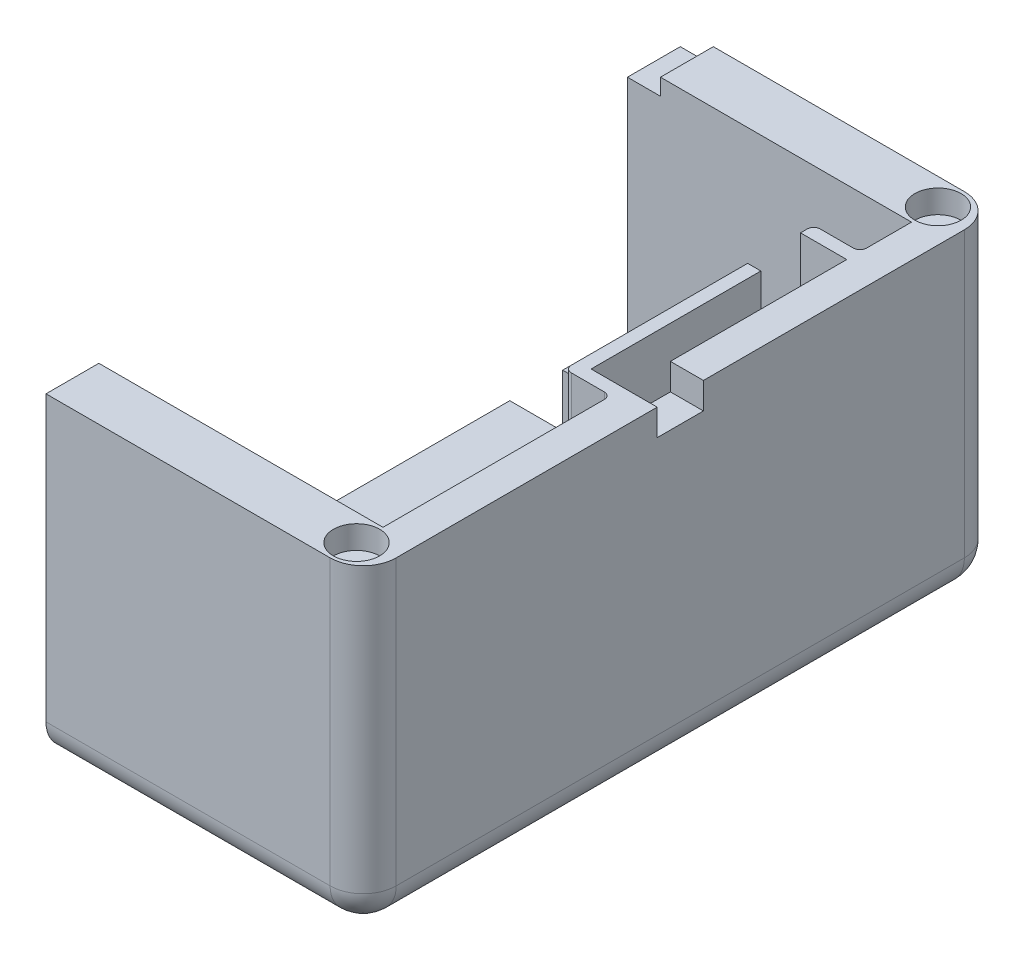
ISO-10303-21;
HEADER;
FILE_DESCRIPTION(('STEP AP214'),'2;1');
FILE_NAME('part.step','',(''),(''),'','','');
FILE_SCHEMA(('AUTOMOTIVE_DESIGN { 1 0 10303 214 1 1 1 1 }'));
ENDSEC;
DATA;
#1=APPLICATION_CONTEXT('core data for automotive mechanical design processes');
#2=APPLICATION_PROTOCOL_DEFINITION('international standard','automotive_design',2000,#1);
#3=PRODUCT_CONTEXT('',#1,'mechanical');
#4=PRODUCT('Part','Part','',(#3));
#5=PRODUCT_RELATED_PRODUCT_CATEGORY('part','',(#4));
#6=PRODUCT_DEFINITION_FORMATION('','',#4);
#7=PRODUCT_DEFINITION_CONTEXT('part definition',#1,'design');
#8=PRODUCT_DEFINITION('design','',#6,#7);
#9=PRODUCT_DEFINITION_SHAPE('','',#8);
#10=(LENGTH_UNIT() NAMED_UNIT(*) SI_UNIT(.MILLI.,.METRE.));
#11=(NAMED_UNIT(*) PLANE_ANGLE_UNIT() SI_UNIT($,.RADIAN.));
#12=(NAMED_UNIT(*) SI_UNIT($,.STERADIAN.) SOLID_ANGLE_UNIT());
#13=UNCERTAINTY_MEASURE_WITH_UNIT(LENGTH_MEASURE(1.E-05),#10,'distance_accuracy_value','');
#14=(GEOMETRIC_REPRESENTATION_CONTEXT(3) GLOBAL_UNCERTAINTY_ASSIGNED_CONTEXT((#13)) GLOBAL_UNIT_ASSIGNED_CONTEXT((#10,
#11,#12)) REPRESENTATION_CONTEXT('',''));
#15=CARTESIAN_POINT('',(0.,0.,0.));
#16=DIRECTION('',(0.,0.,1.));
#17=DIRECTION('',(1.,0.,0.));
#18=AXIS2_PLACEMENT_3D('',#15,#16,#17);
#19=CARTESIAN_POINT('',(-22.5530221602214,-8.75,8.));
#20=DIRECTION('',(1.,0.,0.));
#21=DIRECTION('',(0.,0.,-1.));
#22=AXIS2_PLACEMENT_3D('',#19,#20,#21);
#23=PLANE('',#22);
#24=CARTESIAN_POINT('',(-22.5530221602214,-3.75000000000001,4.));
#25=DIRECTION('',(-1.,0.,0.));
#26=DIRECTION('',(0.,0.,-1.));
#27=AXIS2_PLACEMENT_3D('',#24,#25,#26);
#28=CIRCLE('',#27,3.5);
#29=CARTESIAN_POINT('',(-22.5530221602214,-3.75000000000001,0.500000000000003));
#30=VERTEX_POINT('',#29);
#31=EDGE_CURVE('E947',#30,#30,#28,.T.);
#32=ORIENTED_EDGE('',*,*,#31,.F.);
#33=EDGE_LOOP('',(#32));
#34=FACE_BOUND('',#33,.T.);
#35=DIRECTION('',(0.,0.,-1.));
#36=VECTOR('',#35,1.);
#37=CARTESIAN_POINT('',(-22.5530221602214,3.24999999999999,0.));
#38=LINE('',#37,#36);
#39=CARTESIAN_POINT('',(-22.5530221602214,3.24999999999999,17.8062937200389));
#40=VERTEX_POINT('',#39);
#41=CARTESIAN_POINT('',(-22.5530221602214,3.24999999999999,16.8062937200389));
#42=VERTEX_POINT('',#41);
#43=EDGE_CURVE('E880',#40,#42,#38,.T.);
#44=ORIENTED_EDGE('',*,*,#43,.T.);
#45=CARTESIAN_POINT('',(-22.5530221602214,2.25,16.8062937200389));
#46=DIRECTION('',(1.,0.,0.));
#47=DIRECTION('',(0.,0.,-1.));
#48=AXIS2_PLACEMENT_3D('',#45,#46,#47);
#49=CIRCLE('',#48,1.);
#50=CARTESIAN_POINT('',(-22.5530221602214,2.25,15.8062937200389));
#51=VERTEX_POINT('',#50);
#52=EDGE_CURVE('E516',#42,#51,#49,.F.);
#53=ORIENTED_EDGE('',*,*,#52,.T.);
#54=DIRECTION('',(0.,-1.,0.));
#55=VECTOR('',#54,1.);
#56=CARTESIAN_POINT('',(-22.5530221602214,3.24999999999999,15.8062937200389));
#57=LINE('',#56,#55);
#58=CARTESIAN_POINT('',(-22.5530221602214,-2.75,15.8062937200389));
#59=VERTEX_POINT('',#58);
#60=EDGE_CURVE('E863',#51,#59,#57,.T.);
#61=ORIENTED_EDGE('',*,*,#60,.T.);
#62=CARTESIAN_POINT('',(-22.5530221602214,-2.75,14.8062937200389));
#63=DIRECTION('',(1.,0.,0.));
#64=DIRECTION('',(0.,0.,-1.));
#65=AXIS2_PLACEMENT_3D('',#62,#63,#64);
#66=CIRCLE('',#65,1.);
#67=CARTESIAN_POINT('',(-22.5530221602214,-3.75,14.8062937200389));
#68=VERTEX_POINT('',#67);
#69=EDGE_CURVE('E526',#59,#68,#66,.T.);
#70=ORIENTED_EDGE('',*,*,#69,.T.);
#71=DIRECTION('',(0.,0.,-1.));
#72=VECTOR('',#71,1.);
#73=CARTESIAN_POINT('',(-22.5530221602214,-3.75,88.));
#74=LINE('',#73,#72);
#75=CARTESIAN_POINT('',(-22.5530221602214,-3.75,8.));
#76=VERTEX_POINT('',#75);
#77=EDGE_CURVE('E705',#68,#76,#74,.T.);
#78=ORIENTED_EDGE('',*,*,#77,.T.);
#79=DIRECTION('',(0.,-1.,0.));
#80=VECTOR('',#79,1.);
#81=CARTESIAN_POINT('',(-22.5530221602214,-8.75,8.));
#82=LINE('',#81,#80);
#83=CARTESIAN_POINT('',(-22.5530221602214,36.75,8.));
#84=VERTEX_POINT('',#83);
#85=EDGE_CURVE('E389',#84,#76,#82,.T.);
#86=ORIENTED_EDGE('',*,*,#85,.F.);
#87=DIRECTION('',(0.,0.,-1.));
#88=VECTOR('',#87,1.);
#89=CARTESIAN_POINT('',(-22.5530221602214,36.75,10.));
#90=LINE('',#89,#88);
#91=CARTESIAN_POINT('',(-22.5530221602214,36.75,0.));
#92=VERTEX_POINT('',#91);
#93=EDGE_CURVE('E373',#84,#92,#90,.T.);
#94=ORIENTED_EDGE('',*,*,#93,.T.);
#95=DIRECTION('',(0.,-1.,0.));
#96=VECTOR('',#95,1.);
#97=CARTESIAN_POINT('',(-22.5530221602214,-8.75,0.));
#98=LINE('',#97,#96);
#99=CARTESIAN_POINT('',(-22.5530221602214,-3.75,0.));
#100=VERTEX_POINT('',#99);
#101=EDGE_CURVE('E386',#92,#100,#98,.T.);
#102=ORIENTED_EDGE('',*,*,#101,.T.);
#103=CARTESIAN_POINT('',(-22.5530221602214,-3.75,5.));
#104=DIRECTION('',(1.,0.,0.));
#105=DIRECTION('',(0.,0.,-1.));
#106=AXIS2_PLACEMENT_3D('',#103,#104,#105);
#107=CIRCLE('',#106,5.);
#108=CARTESIAN_POINT('',(-22.5530221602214,-8.75,5.));
#109=VERTEX_POINT('',#108);
#110=EDGE_CURVE('E428',#100,#109,#107,.F.);
#111=ORIENTED_EDGE('',*,*,#110,.T.);
#112=DIRECTION('',(0.,0.,-1.));
#113=VECTOR('',#112,1.);
#114=CARTESIAN_POINT('',(-22.5530221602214,-8.75,8.));
#115=LINE('',#114,#113);
#116=CARTESIAN_POINT('',(-22.5530221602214,-8.75000000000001,44.5));
#117=VERTEX_POINT('',#116);
#118=EDGE_CURVE('E412',#117,#109,#115,.T.);
#119=ORIENTED_EDGE('',*,*,#118,.F.);
#120=DIRECTION('',(0.,-1.,0.));
#121=VECTOR('',#120,1.);
#122=CARTESIAN_POINT('',(-22.5530221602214,1.24999999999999,44.5));
#123=LINE('',#122,#121);
#124=CARTESIAN_POINT('',(-22.5530221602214,-3.75,44.5));
#125=VERTEX_POINT('',#124);
#126=EDGE_CURVE('E745',#125,#117,#123,.T.);
#127=ORIENTED_EDGE('',*,*,#126,.F.);
#128=CARTESIAN_POINT('',(-22.5530221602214,-3.75000000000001,17.8062937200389));
#129=VERTEX_POINT('',#128);
#130=EDGE_CURVE('E714',#125,#129,#74,.T.);
#131=ORIENTED_EDGE('',*,*,#130,.T.);
#132=DIRECTION('',(0.,-1.,0.));
#133=VECTOR('',#132,1.);
#134=CARTESIAN_POINT('',(-22.5530221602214,3.24999999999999,17.8062937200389));
#135=LINE('',#134,#133);
#136=EDGE_CURVE('E758',#40,#129,#135,.T.);
#137=ORIENTED_EDGE('',*,*,#136,.F.);
#138=EDGE_LOOP('',(#44,#53,#61,#70,#78,#86,#94,#102,#111,#119,#127,#131,#137));
#139=FACE_BOUND('',#138,.T.);
#140=ADVANCED_FACE('F35',(#34,#139),#23,.F.);
#141=CARTESIAN_POINT('',(16.6969778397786,3.25000000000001,0.));
#142=DIRECTION('',(0.,1.,0.));
#143=DIRECTION('',(0.,0.,1.));
#144=AXIS2_PLACEMENT_3D('',#141,#142,#143);
#145=PLANE('',#144);
#146=DIRECTION('',(0.,0.,-1.));
#147=VECTOR('',#146,1.);
#148=CARTESIAN_POINT('',(-12.5530221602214,3.25,15.8062937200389));
#149=LINE('',#148,#147);
#150=CARTESIAN_POINT('',(-12.5530221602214,3.25,52.5));
#151=VERTEX_POINT('',#150);
#152=CARTESIAN_POINT('',(-12.5530221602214,3.25,16.8062937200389));
#153=VERTEX_POINT('',#152);
#154=EDGE_CURVE('E512',#151,#153,#149,.T.);
#155=ORIENTED_EDGE('',*,*,#154,.T.);
#156=DIRECTION('',(1.,0.,0.));
#157=VECTOR('',#156,1.);
#158=CARTESIAN_POINT('',(16.6969778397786,3.25000000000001,16.8062937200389));
#159=LINE('',#158,#157);
#160=EDGE_CURVE('E514',#153,#42,#159,.F.);
#161=ORIENTED_EDGE('',*,*,#160,.T.);
#162=ORIENTED_EDGE('',*,*,#43,.F.);
#163=DIRECTION('',(1.,0.,0.));
#164=VECTOR('',#163,1.);
#165=CARTESIAN_POINT('',(16.6969778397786,3.25000000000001,17.8062937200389));
#166=LINE('',#165,#164);
#167=CARTESIAN_POINT('',(-13.5530221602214,3.25,17.8062937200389));
#168=VERTEX_POINT('',#167);
#169=EDGE_CURVE('E931',#40,#168,#166,.T.);
#170=ORIENTED_EDGE('',*,*,#169,.T.);
#171=DIRECTION('',(0.,0.,-1.));
#172=VECTOR('',#171,1.);
#173=CARTESIAN_POINT('',(-13.5530221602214,3.25,0.));
#174=LINE('',#173,#172);
#175=CARTESIAN_POINT('',(-13.5530221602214,3.25,25.8062937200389));
#176=VERTEX_POINT('',#175);
#177=EDGE_CURVE('E903',#176,#168,#174,.T.);
#178=ORIENTED_EDGE('',*,*,#177,.F.);
#179=DIRECTION('',(1.,0.,0.));
#180=VECTOR('',#179,1.);
#181=CARTESIAN_POINT('',(16.6969778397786,3.25000000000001,25.8062937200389));
#182=LINE('',#181,#180);
#183=CARTESIAN_POINT('',(-22.5530221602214,3.24999999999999,25.8062937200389));
#184=VERTEX_POINT('',#183);
#185=EDGE_CURVE('E877',#184,#176,#182,.T.);
#186=ORIENTED_EDGE('',*,*,#185,.F.);
#187=CARTESIAN_POINT('',(-22.5530221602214,3.24999999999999,52.5));
#188=VERTEX_POINT('',#187);
#189=EDGE_CURVE('E874',#188,#184,#38,.T.);
#190=ORIENTED_EDGE('',*,*,#189,.F.);
#191=DIRECTION('',(-1.,0.,0.));
#192=VECTOR('',#191,1.);
#193=CARTESIAN_POINT('',(16.6969778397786,3.25000000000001,52.5));
#194=LINE('',#193,#192);
#195=EDGE_CURVE('E510',#188,#151,#194,.F.);
#196=ORIENTED_EDGE('',*,*,#195,.T.);
#197=EDGE_LOOP('',(#155,#161,#162,#170,#178,#186,#190,#196));
#198=FACE_BOUND('',#197,.T.);
#199=ADVANCED_FACE('F828',(#198),#145,.T.);
#200=CARTESIAN_POINT('',(-22.5530221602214,-3.75,88.));
#201=DIRECTION('',(0.,-1.,0.));
#202=DIRECTION('',(0.,0.,-1.));
#203=AXIS2_PLACEMENT_3D('',#200,#201,#202);
#204=PLANE('',#203);
#205=DIRECTION('',(1.,0.,0.));
#206=VECTOR('',#205,1.);
#207=CARTESIAN_POINT('',(16.6969778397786,-3.74999999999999,17.8062937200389));
#208=LINE('',#207,#206);
#209=CARTESIAN_POINT('',(-13.5530221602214,-3.75,17.8062937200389));
#210=VERTEX_POINT('',#209);
#211=EDGE_CURVE('E889',#129,#210,#208,.T.);
#212=ORIENTED_EDGE('',*,*,#211,.F.);
#213=ORIENTED_EDGE('',*,*,#130,.F.);
#214=DIRECTION('',(-1.,0.,0.));
#215=VECTOR('',#214,1.);
#216=CARTESIAN_POINT('',(-22.5530221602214,-3.75,44.5));
#217=LINE('',#216,#215);
#218=CARTESIAN_POINT('',(-18.5530221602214,-3.75,44.5));
#219=VERTEX_POINT('',#218);
#220=EDGE_CURVE('E475',#219,#125,#217,.T.);
#221=ORIENTED_EDGE('',*,*,#220,.F.);
#222=DIRECTION('',(0.,0.,-1.));
#223=VECTOR('',#222,1.);
#224=CARTESIAN_POINT('',(-18.5530221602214,-3.75,88.));
#225=LINE('',#224,#223);
#226=CARTESIAN_POINT('',(-18.5530221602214,-3.75,51.5));
#227=VERTEX_POINT('',#226);
#228=EDGE_CURVE('E473',#227,#219,#225,.T.);
#229=ORIENTED_EDGE('',*,*,#228,.F.);
#230=DIRECTION('',(1.,0.,0.));
#231=VECTOR('',#230,1.);
#232=CARTESIAN_POINT('',(16.6969778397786,-3.74999999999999,51.5));
#233=LINE('',#232,#231);
#234=CARTESIAN_POINT('',(-13.5530221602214,-3.75,51.5));
#235=VERTEX_POINT('',#234);
#236=EDGE_CURVE('E884',#227,#235,#233,.T.);
#237=ORIENTED_EDGE('',*,*,#236,.T.);
#238=DIRECTION('',(0.,0.,-1.));
#239=VECTOR('',#238,1.);
#240=CARTESIAN_POINT('',(-13.5530221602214,-3.75,0.));
#241=LINE('',#240,#239);
#242=EDGE_CURVE('E892',#235,#210,#241,.T.);
#243=ORIENTED_EDGE('',*,*,#242,.T.);
#244=EDGE_LOOP('',(#212,#213,#221,#229,#237,#243));
#245=FACE_BOUND('',#244,.T.);
#246=ADVANCED_FACE('F835',(#245),#204,.F.);
#247=CARTESIAN_POINT('',(-22.5530221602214,-3.75000000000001,92.));
#248=DIRECTION('',(1.,0.,0.));
#249=DIRECTION('',(0.,0.,1.));
#250=AXIS2_PLACEMENT_3D('',#247,#248,#249);
#251=CIRCLE('',#250,3.5);
#252=CARTESIAN_POINT('',(-22.5530221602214,-3.75000000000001,95.5));
#253=VERTEX_POINT('',#252);
#254=EDGE_CURVE('E853',#253,#253,#251,.T.);
#255=ORIENTED_EDGE('',*,*,#254,.T.);
#256=EDGE_LOOP('',(#255));
#257=FACE_BOUND('',#256,.T.);
#258=DIRECTION('',(0.,-1.,0.));
#259=VECTOR('',#258,1.);
#260=CARTESIAN_POINT('',(-22.5530221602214,3.24999999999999,53.5));
#261=LINE('',#260,#259);
#262=CARTESIAN_POINT('',(-22.5530221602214,2.25,53.5));
#263=VERTEX_POINT('',#262);
#264=CARTESIAN_POINT('',(-22.5530221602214,-2.75,53.5));
#265=VERTEX_POINT('',#264);
#266=EDGE_CURVE('E856',#263,#265,#261,.T.);
#267=ORIENTED_EDGE('',*,*,#266,.F.);
#268=CARTESIAN_POINT('',(-22.5530221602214,2.25,52.5));
#269=DIRECTION('',(1.,0.,0.));
#270=DIRECTION('',(0.,0.,-1.));
#271=AXIS2_PLACEMENT_3D('',#268,#269,#270);
#272=CIRCLE('',#271,1.);
#273=EDGE_CURVE('E524',#263,#188,#272,.F.);
#274=ORIENTED_EDGE('',*,*,#273,.T.);
#275=ORIENTED_EDGE('',*,*,#189,.T.);
#276=DIRECTION('',(0.,1.,0.));
#277=VECTOR('',#276,1.);
#278=CARTESIAN_POINT('',(-22.5530221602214,-1.75000000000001,25.8062937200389));
#279=LINE('',#278,#277);
#280=CARTESIAN_POINT('',(-22.5530221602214,1.24999999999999,25.8062937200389));
#281=VERTEX_POINT('',#280);
#282=EDGE_CURVE('E926',#281,#184,#279,.T.);
#283=ORIENTED_EDGE('',*,*,#282,.F.);
#284=DIRECTION('',(0.,0.,-1.));
#285=VECTOR('',#284,1.);
#286=CARTESIAN_POINT('',(-22.5530221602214,1.24999999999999,51.5));
#287=LINE('',#286,#285);
#288=CARTESIAN_POINT('',(-22.5530221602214,1.24999999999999,51.5));
#289=VERTEX_POINT('',#288);
#290=EDGE_CURVE('E924',#289,#281,#287,.T.);
#291=ORIENTED_EDGE('',*,*,#290,.F.);
#292=DIRECTION('',(0.,-1.,0.));
#293=VECTOR('',#292,1.);
#294=CARTESIAN_POINT('',(-22.5530221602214,1.24999999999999,51.5));
#295=LINE('',#294,#293);
#296=CARTESIAN_POINT('',(-22.5530221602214,-8.75000000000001,51.5));
#297=VERTEX_POINT('',#296);
#298=EDGE_CURVE('E770',#289,#297,#295,.T.);
#299=ORIENTED_EDGE('',*,*,#298,.T.);
#300=CARTESIAN_POINT('',(-22.5530221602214,-8.75,91.));
#301=VERTEX_POINT('',#300);
#302=EDGE_CURVE('E414',#301,#297,#115,.T.);
#303=ORIENTED_EDGE('',*,*,#302,.F.);
#304=CARTESIAN_POINT('',(-22.5530221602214,-3.75,91.));
#305=DIRECTION('',(1.,0.,0.));
#306=DIRECTION('',(0.,0.,-1.));
#307=AXIS2_PLACEMENT_3D('',#304,#305,#306);
#308=CIRCLE('',#307,5.);
#309=CARTESIAN_POINT('',(-22.5530221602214,-3.75,96.));
#310=VERTEX_POINT('',#309);
#311=EDGE_CURVE('E430',#301,#310,#308,.F.);
#312=ORIENTED_EDGE('',*,*,#311,.T.);
#313=DIRECTION('',(0.,-1.,0.));
#314=VECTOR('',#313,1.);
#315=CARTESIAN_POINT('',(-22.5530221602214,-8.75,96.));
#316=LINE('',#315,#314);
#317=CARTESIAN_POINT('',(-22.5530221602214,39.25,96.));
#318=VERTEX_POINT('',#317);
#319=EDGE_CURVE('E685',#318,#310,#316,.T.);
#320=ORIENTED_EDGE('',*,*,#319,.F.);
#321=DIRECTION('',(0.,0.,-1.));
#322=VECTOR('',#321,1.);
#323=CARTESIAN_POINT('',(-22.5530221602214,39.25,96.));
#324=LINE('',#323,#322);
#325=CARTESIAN_POINT('',(-22.5530221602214,39.25,88.));
#326=VERTEX_POINT('',#325);
#327=EDGE_CURVE('E691',#318,#326,#324,.T.);
#328=ORIENTED_EDGE('',*,*,#327,.T.);
#329=DIRECTION('',(0.,-1.,0.));
#330=VECTOR('',#329,1.);
#331=CARTESIAN_POINT('',(-22.5530221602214,-8.75,88.));
#332=LINE('',#331,#330);
#333=CARTESIAN_POINT('',(-22.5530221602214,-3.75,88.));
#334=VERTEX_POINT('',#333);
#335=EDGE_CURVE('E465',#326,#334,#332,.T.);
#336=ORIENTED_EDGE('',*,*,#335,.T.);
#337=CARTESIAN_POINT('',(-22.5530221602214,-3.75,54.5));
#338=VERTEX_POINT('',#337);
#339=EDGE_CURVE('E710',#334,#338,#74,.T.);
#340=ORIENTED_EDGE('',*,*,#339,.T.);
#341=CARTESIAN_POINT('',(-22.5530221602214,-2.75,54.5));
#342=DIRECTION('',(1.,0.,0.));
#343=DIRECTION('',(0.,0.,-1.));
#344=AXIS2_PLACEMENT_3D('',#341,#342,#343);
#345=CIRCLE('',#344,1.);
#346=EDGE_CURVE('E528',#338,#265,#345,.T.);
#347=ORIENTED_EDGE('',*,*,#346,.T.);
#348=EDGE_LOOP('',(#267,#274,#275,#283,#291,#299,#303,#312,#320,#328,#336,#340,#347));
#349=FACE_BOUND('',#348,.T.);
#350=ADVANCED_FACE('F831',(#257,#349),#23,.F.);
#351=CARTESIAN_POINT('',(-22.5530221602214,-8.75,8.));
#352=DIRECTION('',(0.,1.,0.));
#353=DIRECTION('',(0.,0.,1.));
#354=AXIS2_PLACEMENT_3D('',#351,#352,#353);
#355=PLANE('',#354);
#356=DIRECTION('',(-1.,0.,0.));
#357=VECTOR('',#356,1.);
#358=CARTESIAN_POINT('',(-22.5530221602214,-8.75000000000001,44.5));
#359=LINE('',#358,#357);
#360=CARTESIAN_POINT('',(-18.5530221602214,-8.75000000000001,44.5));
#361=VERTEX_POINT('',#360);
#362=EDGE_CURVE('E752',#361,#117,#359,.T.);
#363=ORIENTED_EDGE('',*,*,#362,.T.);
#364=ORIENTED_EDGE('',*,*,#118,.T.);
#365=DIRECTION('',(1.,0.,0.));
#366=VECTOR('',#365,1.);
#367=CARTESIAN_POINT('',(25.4469778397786,-8.75,5.));
#368=LINE('',#367,#366);
#369=CARTESIAN_POINT('',(20.4469778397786,-8.75,5.));
#370=VERTEX_POINT('',#369);
#371=EDGE_CURVE('E424',#109,#370,#368,.T.);
#372=ORIENTED_EDGE('',*,*,#371,.T.);
#373=DIRECTION('',(0.,0.,-1.));
#374=VECTOR('',#373,1.);
#375=CARTESIAN_POINT('',(20.4469778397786,-8.75,8.));
#376=LINE('',#375,#374);
#377=CARTESIAN_POINT('',(20.4469778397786,-8.75,91.));
#378=VERTEX_POINT('',#377);
#379=EDGE_CURVE('E422',#370,#378,#376,.F.);
#380=ORIENTED_EDGE('',*,*,#379,.T.);
#381=DIRECTION('',(1.,0.,0.));
#382=VECTOR('',#381,1.);
#383=CARTESIAN_POINT('',(-22.5530221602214,-8.75,91.));
#384=LINE('',#383,#382);
#385=EDGE_CURVE('E426',#378,#301,#384,.F.);
#386=ORIENTED_EDGE('',*,*,#385,.T.);
#387=ORIENTED_EDGE('',*,*,#302,.T.);
#388=DIRECTION('',(1.,0.,0.));
#389=VECTOR('',#388,1.);
#390=CARTESIAN_POINT('',(-22.5530221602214,-8.75000000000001,51.5));
#391=LINE('',#390,#389);
#392=CARTESIAN_POINT('',(-18.5530221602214,-8.75000000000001,51.5));
#393=VERTEX_POINT('',#392);
#394=EDGE_CURVE('E760',#297,#393,#391,.T.);
#395=ORIENTED_EDGE('',*,*,#394,.T.);
#396=DIRECTION('',(0.,0.,-1.));
#397=VECTOR('',#396,1.);
#398=CARTESIAN_POINT('',(-18.5530221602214,-8.75000000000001,44.5));
#399=LINE('',#398,#397);
#400=EDGE_CURVE('E755',#393,#361,#399,.T.);
#401=ORIENTED_EDGE('',*,*,#400,.T.);
#402=EDGE_LOOP('',(#363,#364,#372,#380,#386,#387,#395,#401));
#403=FACE_BOUND('',#402,.T.);
#404=ADVANCED_FACE('F749',(#403),#355,.F.);
#405=ORIENTED_EDGE('',*,*,#77,.F.);
#406=DIRECTION('',(1.,0.,0.));
#407=VECTOR('',#406,1.);
#408=CARTESIAN_POINT('',(-22.5530221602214,-3.75,14.8062937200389));
#409=LINE('',#408,#407);
#410=CARTESIAN_POINT('',(-12.5530221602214,-3.75,14.8062937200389));
#411=VERTEX_POINT('',#410);
#412=EDGE_CURVE('E492',#68,#411,#409,.T.);
#413=ORIENTED_EDGE('',*,*,#412,.T.);
#414=CARTESIAN_POINT('',(-12.5530221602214,-3.75,16.8062937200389));
#415=DIRECTION('',(0.,-1.,0.));
#416=DIRECTION('',(0.,0.,-1.));
#417=AXIS2_PLACEMENT_3D('',#414,#415,#416);
#418=CIRCLE('',#417,2.);
#419=CARTESIAN_POINT('',(-10.5530221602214,-3.75,16.8062937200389));
#420=VERTEX_POINT('',#419);
#421=EDGE_CURVE('E489',#420,#411,#418,.F.);
#422=ORIENTED_EDGE('',*,*,#421,.F.);
#423=DIRECTION('',(0.,0.,-1.));
#424=VECTOR('',#423,1.);
#425=CARTESIAN_POINT('',(-10.5530221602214,-3.75,53.5));
#426=LINE('',#425,#424);
#427=CARTESIAN_POINT('',(-10.5530221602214,-3.75,52.5));
#428=VERTEX_POINT('',#427);
#429=EDGE_CURVE('E487',#420,#428,#426,.F.);
#430=ORIENTED_EDGE('',*,*,#429,.T.);
#431=CARTESIAN_POINT('',(-12.5530221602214,-3.75,52.5));
#432=DIRECTION('',(0.,-1.,0.));
#433=DIRECTION('',(0.,0.,-1.));
#434=AXIS2_PLACEMENT_3D('',#431,#432,#433);
#435=CIRCLE('',#434,2.);
#436=CARTESIAN_POINT('',(-12.5530221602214,-3.75,54.5));
#437=VERTEX_POINT('',#436);
#438=EDGE_CURVE('E484',#437,#428,#435,.F.);
#439=ORIENTED_EDGE('',*,*,#438,.F.);
#440=DIRECTION('',(-1.,0.,0.));
#441=VECTOR('',#440,1.);
#442=CARTESIAN_POINT('',(-22.5530221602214,-3.75,54.5));
#443=LINE('',#442,#441);
#444=EDGE_CURVE('E482',#437,#338,#443,.T.);
#445=ORIENTED_EDGE('',*,*,#444,.T.);
#446=ORIENTED_EDGE('',*,*,#339,.F.);
#447=DIRECTION('',(-1.,0.,0.));
#448=VECTOR('',#447,1.);
#449=CARTESIAN_POINT('',(-22.5530221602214,-3.75,88.));
#450=LINE('',#449,#448);
#451=CARTESIAN_POINT('',(20.4469778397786,-3.75,88.));
#452=VERTEX_POINT('',#451);
#453=EDGE_CURVE('E701',#452,#334,#450,.T.);
#454=ORIENTED_EDGE('',*,*,#453,.F.);
#455=DIRECTION('',(0.,0.,-1.));
#456=VECTOR('',#455,1.);
#457=CARTESIAN_POINT('',(20.4469778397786,-3.75,88.));
#458=LINE('',#457,#456);
#459=CARTESIAN_POINT('',(20.4469778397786,-3.75,8.));
#460=VERTEX_POINT('',#459);
#461=EDGE_CURVE('E713',#452,#460,#458,.T.);
#462=ORIENTED_EDGE('',*,*,#461,.T.);
#463=DIRECTION('',(-1.,0.,0.));
#464=VECTOR('',#463,1.);
#465=CARTESIAN_POINT('',(-22.5530221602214,-3.75,8.));
#466=LINE('',#465,#464);
#467=EDGE_CURVE('E702',#460,#76,#466,.T.);
#468=ORIENTED_EDGE('',*,*,#467,.T.);
#469=EDGE_LOOP('',(#405,#413,#422,#430,#439,#445,#446,#454,#462,#468));
#470=FACE_BOUND('',#469,.T.);
#471=ADVANCED_FACE('F847',(#470),#204,.F.);
#472=CARTESIAN_POINT('',(-22.5530221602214,39.25,8.));
#473=DIRECTION('',(0.,-1.,0.));
#474=DIRECTION('',(0.,0.,-1.));
#475=AXIS2_PLACEMENT_3D('',#472,#473,#474);
#476=PLANE('',#475);
#477=CARTESIAN_POINT('',(20.4469778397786,39.25,92.));
#478=DIRECTION('',(0.,1.,0.));
#479=DIRECTION('',(0.,0.,1.));
#480=AXIS2_PLACEMENT_3D('',#477,#478,#479);
#481=CIRCLE('',#480,3.5);
#482=CARTESIAN_POINT('',(20.4469778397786,39.25,95.5));
#483=VERTEX_POINT('',#482);
#484=EDGE_CURVE('E937',#483,#483,#481,.T.);
#485=ORIENTED_EDGE('',*,*,#484,.F.);
#486=EDGE_LOOP('',(#485));
#487=FACE_BOUND('',#486,.T.);
#488=DIRECTION('',(0.,0.,-1.));
#489=VECTOR('',#488,1.);
#490=CARTESIAN_POINT('',(13.4469778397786,39.25,0.));
#491=LINE('',#490,#489);
#492=CARTESIAN_POINT('',(13.4469778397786,39.25,52.5));
#493=VERTEX_POINT('',#492);
#494=CARTESIAN_POINT('',(13.4469778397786,39.25,25.8062937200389));
#495=VERTEX_POINT('',#494);
#496=EDGE_CURVE('E635',#493,#495,#491,.T.);
#497=ORIENTED_EDGE('',*,*,#496,.F.);
#498=CARTESIAN_POINT('',(14.4469778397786,39.25,52.5));
#499=DIRECTION('',(0.,-1.,0.));
#500=DIRECTION('',(0.,0.,-1.));
#501=AXIS2_PLACEMENT_3D('',#498,#499,#500);
#502=CIRCLE('',#501,1.);
#503=CARTESIAN_POINT('',(14.4469778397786,39.25,53.5));
#504=VERTEX_POINT('',#503);
#505=EDGE_CURVE('E59',#493,#504,#502,.F.);
#506=ORIENTED_EDGE('',*,*,#505,.T.);
#507=DIRECTION('',(1.,0.,0.));
#508=VECTOR('',#507,1.);
#509=CARTESIAN_POINT('',(13.4469778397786,39.25,53.5));
#510=LINE('',#509,#508);
#511=CARTESIAN_POINT('',(19.4469778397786,39.25,53.5));
#512=VERTEX_POINT('',#511);
#513=EDGE_CURVE('E662',#504,#512,#510,.T.);
#514=ORIENTED_EDGE('',*,*,#513,.T.);
#515=CARTESIAN_POINT('',(19.4469778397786,39.25,54.5));
#516=DIRECTION('',(0.,-1.,0.));
#517=DIRECTION('',(0.,0.,-1.));
#518=AXIS2_PLACEMENT_3D('',#515,#516,#517);
#519=CIRCLE('',#518,1.);
#520=CARTESIAN_POINT('',(20.4469778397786,39.25,54.5));
#521=VERTEX_POINT('',#520);
#522=EDGE_CURVE('E11',#512,#521,#519,.T.);
#523=ORIENTED_EDGE('',*,*,#522,.T.);
#524=DIRECTION('',(0.,0.,-1.));
#525=VECTOR('',#524,1.);
#526=CARTESIAN_POINT('',(20.4469778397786,39.25,88.));
#527=LINE('',#526,#525);
#528=CARTESIAN_POINT('',(20.4469778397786,39.25,88.));
#529=VERTEX_POINT('',#528);
#530=EDGE_CURVE('E397',#529,#521,#527,.T.);
#531=ORIENTED_EDGE('',*,*,#530,.F.);
#532=DIRECTION('',(-1.,0.,0.));
#533=VECTOR('',#532,1.);
#534=CARTESIAN_POINT('',(-22.5530221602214,39.25,88.));
#535=LINE('',#534,#533);
#536=EDGE_CURVE('E689',#529,#326,#535,.T.);
#537=ORIENTED_EDGE('',*,*,#536,.T.);
#538=ORIENTED_EDGE('',*,*,#327,.F.);
#539=DIRECTION('',(-1.,0.,0.));
#540=VECTOR('',#539,1.);
#541=CARTESIAN_POINT('',(-22.5530221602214,39.25,96.));
#542=LINE('',#541,#540);
#543=CARTESIAN_POINT('',(20.4469778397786,39.25,96.));
#544=VERTEX_POINT('',#543);
#545=EDGE_CURVE('E688',#544,#318,#542,.T.);
#546=ORIENTED_EDGE('',*,*,#545,.F.);
#547=CARTESIAN_POINT('',(20.4469778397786,39.25,91.));
#548=DIRECTION('',(0.,-1.,0.));
#549=DIRECTION('',(0.,0.,-1.));
#550=AXIS2_PLACEMENT_3D('',#547,#548,#549);
#551=CIRCLE('',#550,5.);
#552=CARTESIAN_POINT('',(25.4469778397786,39.25,91.));
#553=VERTEX_POINT('',#552);
#554=EDGE_CURVE('E434',#544,#553,#551,.F.);
#555=ORIENTED_EDGE('',*,*,#554,.T.);
#556=DIRECTION('',(0.,0.,-1.));
#557=VECTOR('',#556,1.);
#558=CARTESIAN_POINT('',(25.4469778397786,39.25,8.));
#559=LINE('',#558,#557);
#560=CARTESIAN_POINT('',(25.4469778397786,39.25,51.5));
#561=VERTEX_POINT('',#560);
#562=EDGE_CURVE('E409',#553,#561,#559,.T.);
#563=ORIENTED_EDGE('',*,*,#562,.T.);
#564=DIRECTION('',(1.,0.,0.));
#565=VECTOR('',#564,1.);
#566=CARTESIAN_POINT('',(15.4469778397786,39.25,51.5));
#567=LINE('',#566,#565);
#568=CARTESIAN_POINT('',(15.4469778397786,39.25,51.5));
#569=VERTEX_POINT('',#568);
#570=EDGE_CURVE('E681',#569,#561,#567,.T.);
#571=ORIENTED_EDGE('',*,*,#570,.F.);
#572=DIRECTION('',(0.,0.,-1.));
#573=VECTOR('',#572,1.);
#574=CARTESIAN_POINT('',(15.4469778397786,39.25,51.5));
#575=LINE('',#574,#573);
#576=CARTESIAN_POINT('',(15.4469778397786,39.25,25.8062937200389));
#577=VERTEX_POINT('',#576);
#578=EDGE_CURVE('E786',#569,#577,#575,.T.);
#579=ORIENTED_EDGE('',*,*,#578,.T.);
#580=DIRECTION('',(-1.,0.,0.));
#581=VECTOR('',#580,1.);
#582=CARTESIAN_POINT('',(18.4469778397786,39.25,25.8062937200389));
#583=LINE('',#582,#581);
#584=EDGE_CURVE('E640',#577,#495,#583,.T.);
#585=ORIENTED_EDGE('',*,*,#584,.T.);
#586=EDGE_LOOP('',(#497,#506,#514,#523,#531,#537,#538,#546,#555,#563,#571,#579,#585));
#587=FACE_BOUND('',#586,.T.);
#588=ADVANCED_FACE('F638',(#487,#587),#476,.F.);
#589=CARTESIAN_POINT('',(13.4469778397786,0.,0.));
#590=DIRECTION('',(-1.,0.,0.));
#591=DIRECTION('',(0.,0.,1.));
#592=AXIS2_PLACEMENT_3D('',#589,#590,#591);
#593=PLANE('',#592);
#594=CARTESIAN_POINT('',(13.4469778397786,39.25,17.8062937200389));
#595=VERTEX_POINT('',#594);
#596=CARTESIAN_POINT('',(13.4469778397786,39.25,16.8062937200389));
#597=VERTEX_POINT('',#596);
#598=EDGE_CURVE('E642',#595,#597,#491,.T.);
#599=ORIENTED_EDGE('',*,*,#598,.T.);
#600=DIRECTION('',(0.,-1.,0.));
#601=VECTOR('',#600,1.);
#602=CARTESIAN_POINT('',(13.4469778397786,28.25,16.8062937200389));
#603=LINE('',#602,#601);
#604=CARTESIAN_POINT('',(13.4469778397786,29.25,16.8062937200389));
#605=VERTEX_POINT('',#604);
#606=EDGE_CURVE('E585',#597,#605,#603,.T.);
#607=ORIENTED_EDGE('',*,*,#606,.T.);
#608=DIRECTION('',(0.,0.,-1.));
#609=VECTOR('',#608,1.);
#610=CARTESIAN_POINT('',(13.4469778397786,29.25,0.));
#611=LINE('',#610,#609);
#612=CARTESIAN_POINT('',(13.4469778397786,29.25,52.5));
#613=VERTEX_POINT('',#612);
#614=EDGE_CURVE('E583',#605,#613,#611,.F.);
#615=ORIENTED_EDGE('',*,*,#614,.T.);
#616=DIRECTION('',(0.,1.,0.));
#617=VECTOR('',#616,1.);
#618=CARTESIAN_POINT('',(13.4469778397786,39.25,52.5));
#619=LINE('',#618,#617);
#620=EDGE_CURVE('E581',#613,#493,#619,.T.);
#621=ORIENTED_EDGE('',*,*,#620,.T.);
#622=ORIENTED_EDGE('',*,*,#496,.T.);
#623=DIRECTION('',(0.,-1.,0.));
#624=VECTOR('',#623,1.);
#625=CARTESIAN_POINT('',(13.4469778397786,0.,25.8062937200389));
#626=LINE('',#625,#624);
#627=CARTESIAN_POINT('',(13.4469778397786,30.25,25.8062937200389));
#628=VERTEX_POINT('',#627);
#629=EDGE_CURVE('E780',#495,#628,#626,.T.);
#630=ORIENTED_EDGE('',*,*,#629,.T.);
#631=DIRECTION('',(0.,0.,-1.));
#632=VECTOR('',#631,1.);
#633=CARTESIAN_POINT('',(13.4469778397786,30.25,0.));
#634=LINE('',#633,#632);
#635=CARTESIAN_POINT('',(13.4469778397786,30.25,17.8062937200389));
#636=VERTEX_POINT('',#635);
#637=EDGE_CURVE('E777',#628,#636,#634,.T.);
#638=ORIENTED_EDGE('',*,*,#637,.T.);
#639=DIRECTION('',(0.,-1.,0.));
#640=VECTOR('',#639,1.);
#641=CARTESIAN_POINT('',(13.4469778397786,0.,17.8062937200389));
#642=LINE('',#641,#640);
#643=EDGE_CURVE('E769',#595,#636,#642,.T.);
#644=ORIENTED_EDGE('',*,*,#643,.F.);
#645=EDGE_LOOP('',(#599,#607,#615,#621,#622,#630,#638,#644));
#646=FACE_BOUND('',#645,.T.);
#647=ADVANCED_FACE('F633',(#646),#593,.T.);
#648=CARTESIAN_POINT('',(15.4469778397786,39.25,51.5));
#649=DIRECTION('',(-1.,0.,0.));
#650=DIRECTION('',(0.,0.,1.));
#651=AXIS2_PLACEMENT_3D('',#648,#649,#650);
#652=PLANE('',#651);
#653=DIRECTION('',(0.,-1.,0.));
#654=VECTOR('',#653,1.);
#655=CARTESIAN_POINT('',(15.4469778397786,39.25,25.8062937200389));
#656=LINE('',#655,#654);
#657=CARTESIAN_POINT('',(15.4469778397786,30.25,25.8062937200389));
#658=VERTEX_POINT('',#657);
#659=EDGE_CURVE('E471',#577,#658,#656,.T.);
#660=ORIENTED_EDGE('',*,*,#659,.F.);
#661=ORIENTED_EDGE('',*,*,#578,.F.);
#662=DIRECTION('',(0.,-1.,0.));
#663=VECTOR('',#662,1.);
#664=CARTESIAN_POINT('',(15.4469778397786,39.25,51.5));
#665=LINE('',#664,#663);
#666=CARTESIAN_POINT('',(15.4469778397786,30.25,51.5));
#667=VERTEX_POINT('',#666);
#668=EDGE_CURVE('E649',#569,#667,#665,.T.);
#669=ORIENTED_EDGE('',*,*,#668,.T.);
#670=DIRECTION('',(0.,0.,-1.));
#671=VECTOR('',#670,1.);
#672=CARTESIAN_POINT('',(15.4469778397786,30.25,51.5));
#673=LINE('',#672,#671);
#674=EDGE_CURVE('E784',#667,#658,#673,.T.);
#675=ORIENTED_EDGE('',*,*,#674,.T.);
#676=EDGE_LOOP('',(#660,#661,#669,#675));
#677=FACE_BOUND('',#676,.T.);
#678=ADVANCED_FACE('F791',(#677),#652,.F.);
#679=CARTESIAN_POINT('',(15.4469778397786,39.25,51.5));
#680=DIRECTION('',(0.,0.,1.));
#681=DIRECTION('',(1.,0.,0.));
#682=AXIS2_PLACEMENT_3D('',#679,#680,#681);
#683=PLANE('',#682);
#684=ORIENTED_EDGE('',*,*,#668,.F.);
#685=ORIENTED_EDGE('',*,*,#570,.T.);
#686=DIRECTION('',(0.,-1.,0.));
#687=VECTOR('',#686,1.);
#688=CARTESIAN_POINT('',(25.4469778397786,39.25,51.5));
#689=LINE('',#688,#687);
#690=CARTESIAN_POINT('',(25.4469778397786,35.25,51.5));
#691=VERTEX_POINT('',#690);
#692=EDGE_CURVE('E671',#561,#691,#689,.T.);
#693=ORIENTED_EDGE('',*,*,#692,.T.);
#694=DIRECTION('',(1.,0.,0.));
#695=VECTOR('',#694,1.);
#696=CARTESIAN_POINT('',(15.4469778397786,35.25,51.5));
#697=LINE('',#696,#695);
#698=CARTESIAN_POINT('',(20.4469778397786,35.25,51.5));
#699=VERTEX_POINT('',#698);
#700=EDGE_CURVE('E679',#699,#691,#697,.T.);
#701=ORIENTED_EDGE('',*,*,#700,.F.);
#702=DIRECTION('',(0.,-1.,0.));
#703=VECTOR('',#702,1.);
#704=CARTESIAN_POINT('',(20.4469778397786,0.,51.5));
#705=LINE('',#704,#703);
#706=CARTESIAN_POINT('',(20.4469778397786,30.25,51.5));
#707=VERTEX_POINT('',#706);
#708=EDGE_CURVE('E651',#699,#707,#705,.T.);
#709=ORIENTED_EDGE('',*,*,#708,.T.);
#710=DIRECTION('',(1.,0.,0.));
#711=VECTOR('',#710,1.);
#712=CARTESIAN_POINT('',(13.4469778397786,30.25,51.5));
#713=LINE('',#712,#711);
#714=EDGE_CURVE('E660',#667,#707,#713,.T.);
#715=ORIENTED_EDGE('',*,*,#714,.F.);
#716=EDGE_LOOP('',(#684,#685,#693,#701,#709,#715));
#717=FACE_BOUND('',#716,.T.);
#718=ADVANCED_FACE('F800',(#717),#683,.F.);
#719=CARTESIAN_POINT('',(13.4469778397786,30.25,0.));
#720=DIRECTION('',(0.,-1.,0.));
#721=DIRECTION('',(0.,0.,-1.));
#722=AXIS2_PLACEMENT_3D('',#719,#720,#721);
#723=PLANE('',#722);
#724=DIRECTION('',(1.,0.,0.));
#725=VECTOR('',#724,1.);
#726=CARTESIAN_POINT('',(13.4469778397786,30.25,17.8062937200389));
#727=LINE('',#726,#725);
#728=CARTESIAN_POINT('',(20.4469778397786,30.25,17.8062937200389));
#729=VERTEX_POINT('',#728);
#730=EDGE_CURVE('E644',#636,#729,#727,.T.);
#731=ORIENTED_EDGE('',*,*,#730,.F.);
#732=ORIENTED_EDGE('',*,*,#637,.F.);
#733=DIRECTION('',(-1.,0.,0.));
#734=VECTOR('',#733,1.);
#735=CARTESIAN_POINT('',(18.4469778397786,30.25,25.8062937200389));
#736=LINE('',#735,#734);
#737=EDGE_CURVE('E782',#658,#628,#736,.T.);
#738=ORIENTED_EDGE('',*,*,#737,.F.);
#739=ORIENTED_EDGE('',*,*,#674,.F.);
#740=ORIENTED_EDGE('',*,*,#714,.T.);
#741=DIRECTION('',(0.,0.,-1.));
#742=VECTOR('',#741,1.);
#743=CARTESIAN_POINT('',(20.4469778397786,30.25,0.));
#744=LINE('',#743,#742);
#745=EDGE_CURVE('E654',#707,#729,#744,.T.);
#746=ORIENTED_EDGE('',*,*,#745,.T.);
#747=EDGE_LOOP('',(#731,#732,#738,#739,#740,#746));
#748=FACE_BOUND('',#747,.T.);
#749=ADVANCED_FACE('F796',(#748),#723,.F.);
#750=CARTESIAN_POINT('',(13.4469778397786,0.,17.8062937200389));
#751=DIRECTION('',(0.,0.,1.));
#752=DIRECTION('',(1.,0.,0.));
#753=AXIS2_PLACEMENT_3D('',#750,#751,#752);
#754=PLANE('',#753);
#755=ORIENTED_EDGE('',*,*,#730,.T.);
#756=DIRECTION('',(0.,-1.,0.));
#757=VECTOR('',#756,1.);
#758=CARTESIAN_POINT('',(20.4469778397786,0.,17.8062937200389));
#759=LINE('',#758,#757);
#760=CARTESIAN_POINT('',(20.4469778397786,39.25,17.8062937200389));
#761=VERTEX_POINT('',#760);
#762=EDGE_CURVE('E646',#761,#729,#759,.T.);
#763=ORIENTED_EDGE('',*,*,#762,.F.);
#764=DIRECTION('',(1.,0.,0.));
#765=VECTOR('',#764,1.);
#766=CARTESIAN_POINT('',(13.4469778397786,39.25,17.8062937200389));
#767=LINE('',#766,#765);
#768=EDGE_CURVE('E641',#595,#761,#767,.T.);
#769=ORIENTED_EDGE('',*,*,#768,.F.);
#770=ORIENTED_EDGE('',*,*,#643,.T.);
#771=EDGE_LOOP('',(#755,#763,#769,#770));
#772=FACE_BOUND('',#771,.T.);
#773=ADVANCED_FACE('F810',(#772),#754,.T.);
#774=CARTESIAN_POINT('',(20.4469778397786,-3.75,88.));
#775=DIRECTION('',(1.,0.,0.));
#776=DIRECTION('',(0.,0.,-1.));
#777=AXIS2_PLACEMENT_3D('',#774,#775,#776);
#778=PLANE('',#777);
#779=CARTESIAN_POINT('',(20.4469778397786,29.25,16.8062937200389));
#780=DIRECTION('',(1.,0.,0.));
#781=DIRECTION('',(0.,0.,-1.));
#782=AXIS2_PLACEMENT_3D('',#779,#780,#781);
#783=CIRCLE('',#782,2.);
#784=CARTESIAN_POINT('',(20.4469778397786,29.25,14.8062937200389));
#785=VERTEX_POINT('',#784);
#786=CARTESIAN_POINT('',(20.4469778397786,27.25,16.8062937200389));
#787=VERTEX_POINT('',#786);
#788=EDGE_CURVE('E576',#785,#787,#783,.F.);
#789=ORIENTED_EDGE('',*,*,#788,.F.);
#790=DIRECTION('',(0.,-1.,0.));
#791=VECTOR('',#790,1.);
#792=CARTESIAN_POINT('',(20.4469778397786,39.25,14.8062937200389));
#793=LINE('',#792,#791);
#794=CARTESIAN_POINT('',(20.4469778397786,39.25,14.8062937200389));
#795=VERTEX_POINT('',#794);
#796=EDGE_CURVE('E579',#785,#795,#793,.F.);
#797=ORIENTED_EDGE('',*,*,#796,.T.);
#798=CARTESIAN_POINT('',(20.4469778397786,39.25,8.));
#799=VERTEX_POINT('',#798);
#800=EDGE_CURVE('E404',#795,#799,#527,.T.);
#801=ORIENTED_EDGE('',*,*,#800,.T.);
#802=DIRECTION('',(0.,-1.,0.));
#803=VECTOR('',#802,1.);
#804=CARTESIAN_POINT('',(20.4469778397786,-3.75,8.));
#805=LINE('',#804,#803);
#806=EDGE_CURVE('E697',#799,#460,#805,.T.);
#807=ORIENTED_EDGE('',*,*,#806,.T.);
#808=ORIENTED_EDGE('',*,*,#461,.F.);
#809=DIRECTION('',(0.,-1.,0.));
#810=VECTOR('',#809,1.);
#811=CARTESIAN_POINT('',(20.4469778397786,-3.75,88.));
#812=LINE('',#811,#810);
#813=EDGE_CURVE('E698',#529,#452,#812,.T.);
#814=ORIENTED_EDGE('',*,*,#813,.F.);
#815=ORIENTED_EDGE('',*,*,#530,.T.);
#816=DIRECTION('',(0.,1.,0.));
#817=VECTOR('',#816,1.);
#818=CARTESIAN_POINT('',(20.4469778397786,28.25,54.5));
#819=LINE('',#818,#817);
#820=CARTESIAN_POINT('',(20.4469778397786,27.25,54.5));
#821=VERTEX_POINT('',#820);
#822=EDGE_CURVE('E572',#521,#821,#819,.F.);
#823=ORIENTED_EDGE('',*,*,#822,.T.);
#824=DIRECTION('',(0.,0.,-1.));
#825=VECTOR('',#824,1.);
#826=CARTESIAN_POINT('',(20.4469778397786,27.25,88.));
#827=LINE('',#826,#825);
#828=EDGE_CURVE('E574',#821,#787,#827,.T.);
#829=ORIENTED_EDGE('',*,*,#828,.T.);
#830=EDGE_LOOP('',(#789,#797,#801,#807,#808,#814,#815,#823,#829));
#831=FACE_BOUND('',#830,.T.);
#832=ADVANCED_FACE('F1244',(#831),#778,.F.);
#833=ORIENTED_EDGE('',*,*,#708,.F.);
#834=DIRECTION('',(0.,0.,-1.));
#835=VECTOR('',#834,1.);
#836=CARTESIAN_POINT('',(20.4469778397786,35.25,88.));
#837=LINE('',#836,#835);
#838=CARTESIAN_POINT('',(20.4469778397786,35.25,44.5));
#839=VERTEX_POINT('',#838);
#840=EDGE_CURVE('E446',#699,#839,#837,.T.);
#841=ORIENTED_EDGE('',*,*,#840,.T.);
#842=DIRECTION('',(0.,1.,0.));
#843=VECTOR('',#842,1.);
#844=CARTESIAN_POINT('',(20.4469778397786,-3.75,44.5));
#845=LINE('',#844,#843);
#846=CARTESIAN_POINT('',(20.4469778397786,39.25,44.5));
#847=VERTEX_POINT('',#846);
#848=EDGE_CURVE('E468',#839,#847,#845,.T.);
#849=ORIENTED_EDGE('',*,*,#848,.T.);
#850=EDGE_CURVE('E402',#847,#761,#527,.T.);
#851=ORIENTED_EDGE('',*,*,#850,.T.);
#852=ORIENTED_EDGE('',*,*,#762,.T.);
#853=ORIENTED_EDGE('',*,*,#745,.F.);
#854=EDGE_LOOP('',(#833,#841,#849,#851,#852,#853));
#855=FACE_BOUND('',#854,.T.);
#856=ADVANCED_FACE('F805',(#855),#778,.F.);
#857=CARTESIAN_POINT('',(0.,0.,8.));
#858=DIRECTION('',(0.,0.,-1.));
#859=DIRECTION('',(-1.,0.,0.));
#860=AXIS2_PLACEMENT_3D('',#857,#858,#859);
#861=PLANE('',#860);
#862=DIRECTION('',(-1.,0.,0.));
#863=VECTOR('',#862,1.);
#864=CARTESIAN_POINT('',(-22.5530221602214,39.25,8.));
#865=LINE('',#864,#863);
#866=CARTESIAN_POINT('',(-17.5530221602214,39.25,8.));
#867=VERTEX_POINT('',#866);
#868=EDGE_CURVE('E406',#799,#867,#865,.T.);
#869=ORIENTED_EDGE('',*,*,#868,.T.);
#870=DIRECTION('',(0.,-1.,0.));
#871=VECTOR('',#870,1.);
#872=CARTESIAN_POINT('',(-17.5530221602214,0.,8.));
#873=LINE('',#872,#871);
#874=CARTESIAN_POINT('',(-17.5530221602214,36.75,8.));
#875=VERTEX_POINT('',#874);
#876=EDGE_CURVE('E956',#867,#875,#873,.T.);
#877=ORIENTED_EDGE('',*,*,#876,.T.);
#878=DIRECTION('',(-1.,0.,0.));
#879=VECTOR('',#878,1.);
#880=CARTESIAN_POINT('',(0.,36.75,8.));
#881=LINE('',#880,#879);
#882=EDGE_CURVE('E960',#875,#84,#881,.T.);
#883=ORIENTED_EDGE('',*,*,#882,.T.);
#884=ORIENTED_EDGE('',*,*,#85,.T.);
#885=ORIENTED_EDGE('',*,*,#467,.F.);
#886=ORIENTED_EDGE('',*,*,#806,.F.);
#887=EDGE_LOOP('',(#869,#877,#883,#884,#885,#886));
#888=FACE_BOUND('',#887,.T.);
#889=ADVANCED_FACE('F1257',(#888),#861,.F.);
#890=CARTESIAN_POINT('',(25.4469778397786,-8.75,8.));
#891=DIRECTION('',(-1.,0.,0.));
#892=DIRECTION('',(0.,0.,1.));
#893=AXIS2_PLACEMENT_3D('',#890,#891,#892);
#894=PLANE('',#893);
#895=CARTESIAN_POINT('',(25.4469778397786,39.25,44.5));
#896=VERTEX_POINT('',#895);
#897=CARTESIAN_POINT('',(25.4469778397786,39.25,5.));
#898=VERTEX_POINT('',#897);
#899=EDGE_CURVE('E413',#896,#898,#559,.T.);
#900=ORIENTED_EDGE('',*,*,#899,.F.);
#901=DIRECTION('',(0.,1.,0.));
#902=VECTOR('',#901,1.);
#903=CARTESIAN_POINT('',(25.4469778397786,39.25,44.5));
#904=LINE('',#903,#902);
#905=CARTESIAN_POINT('',(25.4469778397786,35.25,44.5));
#906=VERTEX_POINT('',#905);
#907=EDGE_CURVE('E669',#906,#896,#904,.T.);
#908=ORIENTED_EDGE('',*,*,#907,.F.);
#909=DIRECTION('',(0.,0.,-1.));
#910=VECTOR('',#909,1.);
#911=CARTESIAN_POINT('',(25.4469778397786,35.25,44.5));
#912=LINE('',#911,#910);
#913=EDGE_CURVE('E674',#691,#906,#912,.T.);
#914=ORIENTED_EDGE('',*,*,#913,.F.);
#915=ORIENTED_EDGE('',*,*,#692,.F.);
#916=ORIENTED_EDGE('',*,*,#562,.F.);
#917=DIRECTION('',(0.,1.,0.));
#918=VECTOR('',#917,1.);
#919=CARTESIAN_POINT('',(25.4469778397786,-8.75,91.));
#920=LINE('',#919,#918);
#921=CARTESIAN_POINT('',(25.4469778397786,-3.75,91.));
#922=VERTEX_POINT('',#921);
#923=EDGE_CURVE('E441',#553,#922,#920,.F.);
#924=ORIENTED_EDGE('',*,*,#923,.T.);
#925=DIRECTION('',(0.,0.,-1.));
#926=VECTOR('',#925,1.);
#927=CARTESIAN_POINT('',(25.4469778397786,-3.75,8.));
#928=LINE('',#927,#926);
#929=CARTESIAN_POINT('',(25.4469778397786,-3.75,5.));
#930=VERTEX_POINT('',#929);
#931=EDGE_CURVE('E436',#922,#930,#928,.T.);
#932=ORIENTED_EDGE('',*,*,#931,.T.);
#933=DIRECTION('',(0.,1.,0.));
#934=VECTOR('',#933,1.);
#935=CARTESIAN_POINT('',(25.4469778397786,39.25,5.));
#936=LINE('',#935,#934);
#937=EDGE_CURVE('E438',#930,#898,#936,.T.);
#938=ORIENTED_EDGE('',*,*,#937,.T.);
#939=EDGE_LOOP('',(#900,#908,#914,#915,#916,#924,#932,#938));
#940=FACE_BOUND('',#939,.T.);
#941=ADVANCED_FACE('F731',(#940),#894,.F.);
#942=CARTESIAN_POINT('',(20.4469778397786,39.25,4.));
#943=DIRECTION('',(0.,-1.,0.));
#944=DIRECTION('',(0.,0.,-1.));
#945=AXIS2_PLACEMENT_3D('',#942,#943,#944);
#946=CIRCLE('',#945,3.5);
#947=CARTESIAN_POINT('',(20.4469778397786,39.25,0.500000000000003));
#948=VERTEX_POINT('',#947);
#949=EDGE_CURVE('E953',#948,#948,#946,.T.);
#950=ORIENTED_EDGE('',*,*,#949,.T.);
#951=EDGE_LOOP('',(#950));
#952=FACE_BOUND('',#951,.T.);
#953=DIRECTION('',(1.,0.,0.));
#954=VECTOR('',#953,1.);
#955=CARTESIAN_POINT('',(13.4469778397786,39.25,15.8062937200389));
#956=LINE('',#955,#954);
#957=CARTESIAN_POINT('',(14.4469778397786,39.25,15.8062937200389));
#958=VERTEX_POINT('',#957);
#959=CARTESIAN_POINT('',(19.4469778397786,39.25,15.8062937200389));
#960=VERTEX_POINT('',#959);
#961=EDGE_CURVE('E666',#958,#960,#956,.T.);
#962=ORIENTED_EDGE('',*,*,#961,.F.);
#963=CARTESIAN_POINT('',(14.4469778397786,39.25,16.8062937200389));
#964=DIRECTION('',(0.,-1.,0.));
#965=DIRECTION('',(0.,0.,-1.));
#966=AXIS2_PLACEMENT_3D('',#963,#964,#965);
#967=CIRCLE('',#966,1.);
#968=EDGE_CURVE('E587',#958,#597,#967,.F.);
#969=ORIENTED_EDGE('',*,*,#968,.T.);
#970=ORIENTED_EDGE('',*,*,#598,.F.);
#971=ORIENTED_EDGE('',*,*,#768,.T.);
#972=ORIENTED_EDGE('',*,*,#850,.F.);
#973=DIRECTION('',(1.,0.,0.));
#974=VECTOR('',#973,1.);
#975=CARTESIAN_POINT('',(15.4469778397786,39.25,44.5));
#976=LINE('',#975,#974);
#977=EDGE_CURVE('E677',#847,#896,#976,.T.);
#978=ORIENTED_EDGE('',*,*,#977,.T.);
#979=ORIENTED_EDGE('',*,*,#899,.T.);
#980=CARTESIAN_POINT('',(20.4469778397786,39.25,5.));
#981=DIRECTION('',(0.,-1.,0.));
#982=DIRECTION('',(0.,0.,-1.));
#983=AXIS2_PLACEMENT_3D('',#980,#981,#982);
#984=CIRCLE('',#983,5.);
#985=CARTESIAN_POINT('',(20.4469778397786,39.25,0.));
#986=VERTEX_POINT('',#985);
#987=EDGE_CURVE('E432',#898,#986,#984,.F.);
#988=ORIENTED_EDGE('',*,*,#987,.T.);
#989=DIRECTION('',(-1.,0.,0.));
#990=VECTOR('',#989,1.);
#991=CARTESIAN_POINT('',(-22.5530221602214,39.25,0.));
#992=LINE('',#991,#990);
#993=CARTESIAN_POINT('',(-17.5530221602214,39.25,0.));
#994=VERTEX_POINT('',#993);
#995=EDGE_CURVE('E396',#986,#994,#992,.T.);
#996=ORIENTED_EDGE('',*,*,#995,.T.);
#997=DIRECTION('',(0.,0.,-1.));
#998=VECTOR('',#997,1.);
#999=CARTESIAN_POINT('',(-17.5530221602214,39.25,10.));
#1000=LINE('',#999,#998);
#1001=EDGE_CURVE('E390',#867,#994,#1000,.T.);
#1002=ORIENTED_EDGE('',*,*,#1001,.F.);
#1003=ORIENTED_EDGE('',*,*,#868,.F.);
#1004=ORIENTED_EDGE('',*,*,#800,.F.);
#1005=CARTESIAN_POINT('',(19.4469778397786,39.25,14.8062937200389));
#1006=DIRECTION('',(0.,-1.,0.));
#1007=DIRECTION('',(0.,0.,-1.));
#1008=AXIS2_PLACEMENT_3D('',#1005,#1006,#1007);
#1009=CIRCLE('',#1008,1.);
#1010=EDGE_CURVE('E44',#795,#960,#1009,.T.);
#1011=ORIENTED_EDGE('',*,*,#1010,.T.);
#1012=EDGE_LOOP('',(#962,#969,#970,#971,#972,#978,#979,#988,#996,#1002,#1003,#1004,#1011));
#1013=FACE_BOUND('',#1012,.T.);
#1014=ADVANCED_FACE('F724',(#952,#1013),#476,.F.);
#1015=CARTESIAN_POINT('',(0.,0.,0.));
#1016=DIRECTION('',(0.,0.,-1.));
#1017=DIRECTION('',(-1.,0.,0.));
#1018=AXIS2_PLACEMENT_3D('',#1015,#1016,#1017);
#1019=PLANE('',#1018);
#1020=DIRECTION('',(0.,-1.,0.));
#1021=VECTOR('',#1020,1.);
#1022=CARTESIAN_POINT('',(-17.5530221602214,39.25,0.));
#1023=LINE('',#1022,#1021);
#1024=CARTESIAN_POINT('',(-17.5530221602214,36.75,0.));
#1025=VERTEX_POINT('',#1024);
#1026=EDGE_CURVE('E380',#994,#1025,#1023,.T.);
#1027=ORIENTED_EDGE('',*,*,#1026,.F.);
#1028=ORIENTED_EDGE('',*,*,#995,.F.);
#1029=DIRECTION('',(0.,1.,0.));
#1030=VECTOR('',#1029,1.);
#1031=CARTESIAN_POINT('',(20.4469778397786,-8.75,0.));
#1032=LINE('',#1031,#1030);
#1033=CARTESIAN_POINT('',(20.4469778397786,-3.75,0.));
#1034=VERTEX_POINT('',#1033);
#1035=EDGE_CURVE('E443',#986,#1034,#1032,.F.);
#1036=ORIENTED_EDGE('',*,*,#1035,.T.);
#1037=DIRECTION('',(1.,0.,0.));
#1038=VECTOR('',#1037,1.);
#1039=CARTESIAN_POINT('',(-22.5530221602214,-3.75,0.));
#1040=LINE('',#1039,#1038);
#1041=EDGE_CURVE('E394',#1034,#100,#1040,.F.);
#1042=ORIENTED_EDGE('',*,*,#1041,.T.);
#1043=ORIENTED_EDGE('',*,*,#101,.F.);
#1044=DIRECTION('',(-1.,0.,0.));
#1045=VECTOR('',#1044,1.);
#1046=CARTESIAN_POINT('',(-17.5530221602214,36.75,0.));
#1047=LINE('',#1046,#1045);
#1048=EDGE_CURVE('E370',#1025,#92,#1047,.T.);
#1049=ORIENTED_EDGE('',*,*,#1048,.F.);
#1050=EDGE_LOOP('',(#1027,#1028,#1036,#1042,#1043,#1049));
#1051=FACE_BOUND('',#1050,.T.);
#1052=ADVANCED_FACE('F392',(#1051),#1019,.T.);
#1053=CARTESIAN_POINT('',(0.,0.,96.));
#1054=DIRECTION('',(0.,0.,-1.));
#1055=DIRECTION('',(-1.,0.,0.));
#1056=AXIS2_PLACEMENT_3D('',#1053,#1054,#1055);
#1057=PLANE('',#1056);
#1058=ORIENTED_EDGE('',*,*,#319,.T.);
#1059=DIRECTION('',(1.,0.,0.));
#1060=VECTOR('',#1059,1.);
#1061=CARTESIAN_POINT('',(0.,-3.75,96.));
#1062=LINE('',#1061,#1060);
#1063=CARTESIAN_POINT('',(20.4469778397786,-3.75,96.));
#1064=VERTEX_POINT('',#1063);
#1065=EDGE_CURVE('E419',#310,#1064,#1062,.T.);
#1066=ORIENTED_EDGE('',*,*,#1065,.T.);
#1067=DIRECTION('',(0.,1.,0.));
#1068=VECTOR('',#1067,1.);
#1069=CARTESIAN_POINT('',(20.4469778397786,0.,96.));
#1070=LINE('',#1069,#1068);
#1071=EDGE_CURVE('E417',#1064,#544,#1070,.T.);
#1072=ORIENTED_EDGE('',*,*,#1071,.T.);
#1073=ORIENTED_EDGE('',*,*,#545,.T.);
#1074=EDGE_LOOP('',(#1058,#1066,#1072,#1073));
#1075=FACE_BOUND('',#1074,.T.);
#1076=ADVANCED_FACE('F1143',(#1075),#1057,.F.);
#1077=CARTESIAN_POINT('',(0.,0.,88.));
#1078=DIRECTION('',(0.,0.,-1.));
#1079=DIRECTION('',(-1.,0.,0.));
#1080=AXIS2_PLACEMENT_3D('',#1077,#1078,#1079);
#1081=PLANE('',#1080);
#1082=CARTESIAN_POINT('',(4.52697783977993,22.9099999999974,88.));
#1083=DIRECTION('',(0.,0.,-1.));
#1084=DIRECTION('',(-1.,0.,0.));
#1085=AXIS2_PLACEMENT_3D('',#1082,#1083,#1084);
#1086=CIRCLE('',#1085,5.);
#1087=CARTESIAN_POINT('',(-0.473022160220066,22.9099999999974,88.));
#1088=VERTEX_POINT('',#1087);
#1089=EDGE_CURVE('E479',#1088,#1088,#1086,.T.);
#1090=ORIENTED_EDGE('',*,*,#1089,.F.);
#1091=EDGE_LOOP('',(#1090));
#1092=FACE_BOUND('',#1091,.T.);
#1093=ORIENTED_EDGE('',*,*,#536,.F.);
#1094=ORIENTED_EDGE('',*,*,#813,.T.);
#1095=ORIENTED_EDGE('',*,*,#453,.T.);
#1096=ORIENTED_EDGE('',*,*,#335,.F.);
#1097=EDGE_LOOP('',(#1093,#1094,#1095,#1096));
#1098=FACE_BOUND('',#1097,.T.);
#1099=ADVANCED_FACE('F1139',(#1092,#1098),#1081,.T.);
#1100=CARTESIAN_POINT('',(20.4469778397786,-8.75,5.));
#1101=DIRECTION('',(0.,-1.,0.));
#1102=DIRECTION('',(0.,0.,-1.));
#1103=AXIS2_PLACEMENT_3D('',#1100,#1101,#1102);
#1104=CYLINDRICAL_SURFACE('',#1103,5.);
#1105=ORIENTED_EDGE('',*,*,#987,.F.);
#1106=ORIENTED_EDGE('',*,*,#937,.F.);
#1107=CARTESIAN_POINT('',(20.4469778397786,-3.75,5.));
#1108=DIRECTION('',(0.,-1.,0.));
#1109=DIRECTION('',(0.,0.,-1.));
#1110=AXIS2_PLACEMENT_3D('',#1107,#1108,#1109);
#1111=CIRCLE('',#1110,5.);
#1112=EDGE_CURVE('E462',#1034,#930,#1111,.T.);
#1113=ORIENTED_EDGE('',*,*,#1112,.F.);
#1114=ORIENTED_EDGE('',*,*,#1035,.F.);
#1115=EDGE_LOOP('',(#1105,#1106,#1113,#1114));
#1116=FACE_BOUND('',#1115,.T.);
#1117=ADVANCED_FACE('F736',(#1116),#1104,.T.);
#1118=CARTESIAN_POINT('',(-22.5530221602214,-3.75,5.));
#1119=DIRECTION('',(-1.,0.,0.));
#1120=DIRECTION('',(0.,0.,1.));
#1121=AXIS2_PLACEMENT_3D('',#1118,#1119,#1120);
#1122=CYLINDRICAL_SURFACE('',#1121,5.);
#1123=ORIENTED_EDGE('',*,*,#110,.F.);
#1124=ORIENTED_EDGE('',*,*,#1041,.F.);
#1125=CARTESIAN_POINT('',(20.4469778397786,-3.75,5.));
#1126=DIRECTION('',(1.,0.,0.));
#1127=DIRECTION('',(0.,0.,-1.));
#1128=AXIS2_PLACEMENT_3D('',#1125,#1126,#1127);
#1129=CIRCLE('',#1128,5.);
#1130=EDGE_CURVE('E459',#370,#1034,#1129,.T.);
#1131=ORIENTED_EDGE('',*,*,#1130,.F.);
#1132=ORIENTED_EDGE('',*,*,#371,.F.);
#1133=EDGE_LOOP('',(#1123,#1124,#1131,#1132));
#1134=FACE_BOUND('',#1133,.T.);
#1135=ADVANCED_FACE('F739',(#1134),#1122,.T.);
#1136=CARTESIAN_POINT('',(20.4469778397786,-3.75,5.));
#1137=DIRECTION('',(0.,0.,1.));
#1138=DIRECTION('',(1.,0.,0.));
#1139=AXIS2_PLACEMENT_3D('',#1136,#1137,#1138);
#1140=SPHERICAL_SURFACE('',#1139,5.);
#1141=ORIENTED_EDGE('',*,*,#1130,.T.);
#1142=ORIENTED_EDGE('',*,*,#1112,.T.);
#1143=CARTESIAN_POINT('',(20.4469778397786,-3.75,5.));
#1144=DIRECTION('',(0.,0.,-1.));
#1145=DIRECTION('',(-1.,0.,0.));
#1146=AXIS2_PLACEMENT_3D('',#1143,#1144,#1145);
#1147=CIRCLE('',#1146,5.);
#1148=EDGE_CURVE('E456',#370,#930,#1147,.F.);
#1149=ORIENTED_EDGE('',*,*,#1148,.F.);
#1150=EDGE_LOOP('',(#1141,#1142,#1149));
#1151=FACE_BOUND('',#1150,.T.);
#1152=ADVANCED_FACE('F1303',(#1151),#1140,.T.);
#1153=CARTESIAN_POINT('',(20.4469778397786,0.,91.));
#1154=DIRECTION('',(0.,1.,0.));
#1155=DIRECTION('',(0.,0.,1.));
#1156=AXIS2_PLACEMENT_3D('',#1153,#1154,#1155);
#1157=CYLINDRICAL_SURFACE('',#1156,5.);
#1158=ORIENTED_EDGE('',*,*,#554,.F.);
#1159=ORIENTED_EDGE('',*,*,#1071,.F.);
#1160=CARTESIAN_POINT('',(20.4469778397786,-3.75,91.));
#1161=DIRECTION('',(0.,-1.,0.));
#1162=DIRECTION('',(0.,0.,-1.));
#1163=AXIS2_PLACEMENT_3D('',#1160,#1161,#1162);
#1164=CIRCLE('',#1163,5.);
#1165=EDGE_CURVE('E453',#922,#1064,#1164,.T.);
#1166=ORIENTED_EDGE('',*,*,#1165,.F.);
#1167=ORIENTED_EDGE('',*,*,#923,.F.);
#1168=EDGE_LOOP('',(#1158,#1159,#1166,#1167));
#1169=FACE_BOUND('',#1168,.T.);
#1170=ADVANCED_FACE('F1312',(#1169),#1157,.T.);
#1171=CARTESIAN_POINT('',(20.4469778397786,-3.75,8.));
#1172=DIRECTION('',(0.,0.,-1.));
#1173=DIRECTION('',(-1.,0.,0.));
#1174=AXIS2_PLACEMENT_3D('',#1171,#1172,#1173);
#1175=CYLINDRICAL_SURFACE('',#1174,5.);
#1176=ORIENTED_EDGE('',*,*,#1148,.T.);
#1177=ORIENTED_EDGE('',*,*,#931,.F.);
#1178=CARTESIAN_POINT('',(20.4469778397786,-3.75,91.));
#1179=DIRECTION('',(0.,0.,1.));
#1180=DIRECTION('',(1.,0.,0.));
#1181=AXIS2_PLACEMENT_3D('',#1178,#1179,#1180);
#1182=CIRCLE('',#1181,5.);
#1183=EDGE_CURVE('E449',#378,#922,#1182,.T.);
#1184=ORIENTED_EDGE('',*,*,#1183,.F.);
#1185=ORIENTED_EDGE('',*,*,#379,.F.);
#1186=EDGE_LOOP('',(#1176,#1177,#1184,#1185));
#1187=FACE_BOUND('',#1186,.T.);
#1188=ADVANCED_FACE('F1322',(#1187),#1175,.T.);
#1189=CARTESIAN_POINT('',(20.4469778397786,-3.75,91.));
#1190=DIRECTION('',(0.,0.,1.));
#1191=DIRECTION('',(1.,0.,0.));
#1192=AXIS2_PLACEMENT_3D('',#1189,#1190,#1191);
#1193=SPHERICAL_SURFACE('',#1192,5.);
#1194=ORIENTED_EDGE('',*,*,#1183,.T.);
#1195=ORIENTED_EDGE('',*,*,#1165,.T.);
#1196=CARTESIAN_POINT('',(20.4469778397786,-3.75,91.));
#1197=DIRECTION('',(1.,0.,0.));
#1198=DIRECTION('',(0.,0.,-1.));
#1199=AXIS2_PLACEMENT_3D('',#1196,#1197,#1198);
#1200=CIRCLE('',#1199,5.);
#1201=EDGE_CURVE('E447',#378,#1064,#1200,.F.);
#1202=ORIENTED_EDGE('',*,*,#1201,.F.);
#1203=EDGE_LOOP('',(#1194,#1195,#1202));
#1204=FACE_BOUND('',#1203,.T.);
#1205=ADVANCED_FACE('F1332',(#1204),#1193,.T.);
#1206=CARTESIAN_POINT('',(0.,-3.75,91.));
#1207=DIRECTION('',(1.,0.,0.));
#1208=DIRECTION('',(0.,0.,-1.));
#1209=AXIS2_PLACEMENT_3D('',#1206,#1207,#1208);
#1210=CYLINDRICAL_SURFACE('',#1209,5.);
#1211=ORIENTED_EDGE('',*,*,#311,.F.);
#1212=ORIENTED_EDGE('',*,*,#385,.F.);
#1213=ORIENTED_EDGE('',*,*,#1201,.T.);
#1214=ORIENTED_EDGE('',*,*,#1065,.F.);
#1215=EDGE_LOOP('',(#1211,#1212,#1213,#1214));
#1216=FACE_BOUND('',#1215,.T.);
#1217=ADVANCED_FACE('F1341',(#1216),#1210,.T.);
#1218=CARTESIAN_POINT('',(15.4469778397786,39.25,44.5));
#1219=DIRECTION('',(0.,0.,-1.));
#1220=DIRECTION('',(-1.,0.,0.));
#1221=AXIS2_PLACEMENT_3D('',#1218,#1219,#1220);
#1222=PLANE('',#1221);
#1223=DIRECTION('',(1.,0.,0.));
#1224=VECTOR('',#1223,1.);
#1225=CARTESIAN_POINT('',(15.4469778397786,35.25,44.5));
#1226=LINE('',#1225,#1224);
#1227=EDGE_CURVE('E450',#839,#906,#1226,.T.);
#1228=ORIENTED_EDGE('',*,*,#1227,.T.);
#1229=ORIENTED_EDGE('',*,*,#907,.T.);
#1230=ORIENTED_EDGE('',*,*,#977,.F.);
#1231=ORIENTED_EDGE('',*,*,#848,.F.);
#1232=EDGE_LOOP('',(#1228,#1229,#1230,#1231));
#1233=FACE_BOUND('',#1232,.T.);
#1234=ADVANCED_FACE('F1350',(#1233),#1222,.F.);
#1235=CARTESIAN_POINT('',(15.4469778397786,35.25,44.5));
#1236=DIRECTION('',(0.,-1.,0.));
#1237=DIRECTION('',(0.,0.,-1.));
#1238=AXIS2_PLACEMENT_3D('',#1235,#1236,#1237);
#1239=PLANE('',#1238);
#1240=ORIENTED_EDGE('',*,*,#700,.T.);
#1241=ORIENTED_EDGE('',*,*,#913,.T.);
#1242=ORIENTED_EDGE('',*,*,#1227,.F.);
#1243=ORIENTED_EDGE('',*,*,#840,.F.);
#1244=EDGE_LOOP('',(#1240,#1241,#1242,#1243));
#1245=FACE_BOUND('',#1244,.T.);
#1246=ADVANCED_FACE('F1359',(#1245),#1239,.F.);
#1247=CARTESIAN_POINT('',(13.4469778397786,0.,15.8062937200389));
#1248=DIRECTION('',(0.,0.,1.));
#1249=DIRECTION('',(1.,0.,0.));
#1250=AXIS2_PLACEMENT_3D('',#1247,#1248,#1249);
#1251=PLANE('',#1250);
#1252=ORIENTED_EDGE('',*,*,#961,.T.);
#1253=DIRECTION('',(0.,-1.,0.));
#1254=VECTOR('',#1253,1.);
#1255=CARTESIAN_POINT('',(19.4469778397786,28.25,15.8062937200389));
#1256=LINE('',#1255,#1254);
#1257=CARTESIAN_POINT('',(19.4469778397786,29.25,15.8062937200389));
#1258=VERTEX_POINT('',#1257);
#1259=EDGE_CURVE('E569',#960,#1258,#1256,.T.);
#1260=ORIENTED_EDGE('',*,*,#1259,.T.);
#1261=DIRECTION('',(1.,0.,0.));
#1262=VECTOR('',#1261,1.);
#1263=CARTESIAN_POINT('',(13.4469778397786,29.25,15.8062937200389));
#1264=LINE('',#1263,#1262);
#1265=CARTESIAN_POINT('',(14.4469778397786,29.25,15.8062937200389));
#1266=VERTEX_POINT('',#1265);
#1267=EDGE_CURVE('E530',#1258,#1266,#1264,.F.);
#1268=ORIENTED_EDGE('',*,*,#1267,.T.);
#1269=DIRECTION('',(0.,-1.,0.));
#1270=VECTOR('',#1269,1.);
#1271=CARTESIAN_POINT('',(14.4469778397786,39.25,15.8062937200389));
#1272=LINE('',#1271,#1270);
#1273=EDGE_CURVE('E567',#1266,#958,#1272,.F.);
#1274=ORIENTED_EDGE('',*,*,#1273,.T.);
#1275=EDGE_LOOP('',(#1252,#1260,#1268,#1274));
#1276=FACE_BOUND('',#1275,.T.);
#1277=ADVANCED_FACE('F1365',(#1276),#1251,.F.);
#1278=CARTESIAN_POINT('',(13.4469778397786,28.25,0.));
#1279=DIRECTION('',(0.,-1.,0.));
#1280=DIRECTION('',(0.,0.,-1.));
#1281=AXIS2_PLACEMENT_3D('',#1278,#1279,#1280);
#1282=PLANE('',#1281);
#1283=DIRECTION('',(1.,0.,0.));
#1284=VECTOR('',#1283,1.);
#1285=CARTESIAN_POINT('',(13.4469778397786,28.25,53.5));
#1286=LINE('',#1285,#1284);
#1287=CARTESIAN_POINT('',(14.4469778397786,28.25,53.5));
#1288=VERTEX_POINT('',#1287);
#1289=CARTESIAN_POINT('',(19.4469778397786,28.25,53.5));
#1290=VERTEX_POINT('',#1289);
#1291=EDGE_CURVE('E664',#1288,#1290,#1286,.T.);
#1292=ORIENTED_EDGE('',*,*,#1291,.F.);
#1293=DIRECTION('',(0.,0.,-1.));
#1294=VECTOR('',#1293,1.);
#1295=CARTESIAN_POINT('',(14.4469778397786,28.25,0.));
#1296=LINE('',#1295,#1294);
#1297=CARTESIAN_POINT('',(14.4469778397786,28.25,16.8062937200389));
#1298=VERTEX_POINT('',#1297);
#1299=EDGE_CURVE('E593',#1288,#1298,#1296,.T.);
#1300=ORIENTED_EDGE('',*,*,#1299,.T.);
#1301=DIRECTION('',(1.,0.,0.));
#1302=VECTOR('',#1301,1.);
#1303=CARTESIAN_POINT('',(20.4469778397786,28.25,16.8062937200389));
#1304=LINE('',#1303,#1302);
#1305=CARTESIAN_POINT('',(19.4469778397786,28.25,16.8062937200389));
#1306=VERTEX_POINT('',#1305);
#1307=EDGE_CURVE('E591',#1298,#1306,#1304,.T.);
#1308=ORIENTED_EDGE('',*,*,#1307,.T.);
#1309=DIRECTION('',(0.,0.,-1.));
#1310=VECTOR('',#1309,1.);
#1311=CARTESIAN_POINT('',(19.4469778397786,28.25,0.));
#1312=LINE('',#1311,#1310);
#1313=EDGE_CURVE('E589',#1306,#1290,#1312,.F.);
#1314=ORIENTED_EDGE('',*,*,#1313,.T.);
#1315=EDGE_LOOP('',(#1292,#1300,#1308,#1314));
#1316=FACE_BOUND('',#1315,.T.);
#1317=ADVANCED_FACE('F824',(#1316),#1282,.T.);
#1318=CARTESIAN_POINT('',(13.4469778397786,0.,53.5));
#1319=DIRECTION('',(0.,0.,-1.));
#1320=DIRECTION('',(-1.,0.,0.));
#1321=AXIS2_PLACEMENT_3D('',#1318,#1319,#1320);
#1322=PLANE('',#1321);
#1323=ORIENTED_EDGE('',*,*,#513,.F.);
#1324=DIRECTION('',(0.,1.,0.));
#1325=VECTOR('',#1324,1.);
#1326=CARTESIAN_POINT('',(14.4469778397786,28.25,53.5));
#1327=LINE('',#1326,#1325);
#1328=EDGE_CURVE('E597',#504,#1288,#1327,.F.);
#1329=ORIENTED_EDGE('',*,*,#1328,.T.);
#1330=ORIENTED_EDGE('',*,*,#1291,.T.);
#1331=DIRECTION('',(0.,1.,0.));
#1332=VECTOR('',#1331,1.);
#1333=CARTESIAN_POINT('',(19.4469778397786,39.25,53.5));
#1334=LINE('',#1333,#1332);
#1335=EDGE_CURVE('E52',#1290,#512,#1334,.T.);
#1336=ORIENTED_EDGE('',*,*,#1335,.T.);
#1337=EDGE_LOOP('',(#1323,#1329,#1330,#1336));
#1338=FACE_BOUND('',#1337,.T.);
#1339=ADVANCED_FACE('F816',(#1338),#1322,.F.);
#1340=CARTESIAN_POINT('',(18.4469778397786,0.,25.8062937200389));
#1341=DIRECTION('',(0.,0.,-1.));
#1342=DIRECTION('',(-1.,0.,0.));
#1343=AXIS2_PLACEMENT_3D('',#1340,#1341,#1342);
#1344=PLANE('',#1343);
#1345=ORIENTED_EDGE('',*,*,#659,.T.);
#1346=ORIENTED_EDGE('',*,*,#737,.T.);
#1347=ORIENTED_EDGE('',*,*,#629,.F.);
#1348=ORIENTED_EDGE('',*,*,#584,.F.);
#1349=EDGE_LOOP('',(#1345,#1346,#1347,#1348));
#1350=FACE_BOUND('',#1349,.T.);
#1351=ADVANCED_FACE('F813',(#1350),#1344,.T.);
#1352=CARTESIAN_POINT('',(-22.5530221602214,1.24999999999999,44.5));
#1353=DIRECTION('',(0.,0.,1.));
#1354=DIRECTION('',(1.,0.,0.));
#1355=AXIS2_PLACEMENT_3D('',#1352,#1353,#1354);
#1356=PLANE('',#1355);
#1357=ORIENTED_EDGE('',*,*,#220,.T.);
#1358=ORIENTED_EDGE('',*,*,#126,.T.);
#1359=ORIENTED_EDGE('',*,*,#362,.F.);
#1360=DIRECTION('',(0.,-1.,0.));
#1361=VECTOR('',#1360,1.);
#1362=CARTESIAN_POINT('',(-18.5530221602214,1.24999999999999,44.5));
#1363=LINE('',#1362,#1361);
#1364=EDGE_CURVE('E767',#219,#361,#1363,.T.);
#1365=ORIENTED_EDGE('',*,*,#1364,.F.);
#1366=EDGE_LOOP('',(#1357,#1358,#1359,#1365));
#1367=FACE_BOUND('',#1366,.T.);
#1368=ADVANCED_FACE('F815',(#1367),#1356,.T.);
#1369=CARTESIAN_POINT('',(-22.5530221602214,1.24999999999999,51.5));
#1370=DIRECTION('',(0.,0.,-1.));
#1371=DIRECTION('',(-1.,0.,0.));
#1372=AXIS2_PLACEMENT_3D('',#1369,#1370,#1371);
#1373=PLANE('',#1372);
#1374=DIRECTION('',(1.,0.,0.));
#1375=VECTOR('',#1374,1.);
#1376=CARTESIAN_POINT('',(-22.5530221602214,1.24999999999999,51.5));
#1377=LINE('',#1376,#1375);
#1378=CARTESIAN_POINT('',(-13.5530221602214,1.24999999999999,51.5));
#1379=VERTEX_POINT('',#1378);
#1380=EDGE_CURVE('E887',#289,#1379,#1377,.T.);
#1381=ORIENTED_EDGE('',*,*,#1380,.T.);
#1382=DIRECTION('',(0.,-1.,0.));
#1383=VECTOR('',#1382,1.);
#1384=CARTESIAN_POINT('',(-13.5530221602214,3.25,51.5));
#1385=LINE('',#1384,#1383);
#1386=EDGE_CURVE('E862',#1379,#235,#1385,.T.);
#1387=ORIENTED_EDGE('',*,*,#1386,.T.);
#1388=ORIENTED_EDGE('',*,*,#236,.F.);
#1389=DIRECTION('',(0.,-1.,0.));
#1390=VECTOR('',#1389,1.);
#1391=CARTESIAN_POINT('',(-18.5530221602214,1.24999999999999,51.5));
#1392=LINE('',#1391,#1390);
#1393=EDGE_CURVE('E772',#227,#393,#1392,.T.);
#1394=ORIENTED_EDGE('',*,*,#1393,.T.);
#1395=ORIENTED_EDGE('',*,*,#394,.F.);
#1396=ORIENTED_EDGE('',*,*,#298,.F.);
#1397=EDGE_LOOP('',(#1381,#1387,#1388,#1394,#1395,#1396));
#1398=FACE_BOUND('',#1397,.T.);
#1399=ADVANCED_FACE('F822',(#1398),#1373,.T.);
#1400=CARTESIAN_POINT('',(-18.5530221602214,1.24999999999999,44.5));
#1401=DIRECTION('',(-1.,0.,0.));
#1402=DIRECTION('',(0.,-1.,0.));
#1403=AXIS2_PLACEMENT_3D('',#1400,#1401,#1402);
#1404=PLANE('',#1403);
#1405=ORIENTED_EDGE('',*,*,#228,.T.);
#1406=ORIENTED_EDGE('',*,*,#1364,.T.);
#1407=ORIENTED_EDGE('',*,*,#400,.F.);
#1408=ORIENTED_EDGE('',*,*,#1393,.F.);
#1409=EDGE_LOOP('',(#1405,#1406,#1407,#1408));
#1410=FACE_BOUND('',#1409,.T.);
#1411=ADVANCED_FACE('F915',(#1410),#1404,.T.);
#1412=CARTESIAN_POINT('',(16.6969778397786,3.25000000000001,17.8062937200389));
#1413=DIRECTION('',(0.,0.,-1.));
#1414=DIRECTION('',(-1.,0.,0.));
#1415=AXIS2_PLACEMENT_3D('',#1412,#1413,#1414);
#1416=PLANE('',#1415);
#1417=ORIENTED_EDGE('',*,*,#136,.T.);
#1418=ORIENTED_EDGE('',*,*,#211,.T.);
#1419=DIRECTION('',(0.,-1.,0.));
#1420=VECTOR('',#1419,1.);
#1421=CARTESIAN_POINT('',(-13.5530221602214,3.25,17.8062937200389));
#1422=LINE('',#1421,#1420);
#1423=EDGE_CURVE('E762',#168,#210,#1422,.T.);
#1424=ORIENTED_EDGE('',*,*,#1423,.F.);
#1425=ORIENTED_EDGE('',*,*,#169,.F.);
#1426=EDGE_LOOP('',(#1417,#1418,#1424,#1425));
#1427=FACE_BOUND('',#1426,.T.);
#1428=ADVANCED_FACE('F908',(#1427),#1416,.F.);
#1429=CARTESIAN_POINT('',(-13.5530221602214,3.25,0.));
#1430=DIRECTION('',(-1.,0.,0.));
#1431=DIRECTION('',(0.,-1.,0.));
#1432=AXIS2_PLACEMENT_3D('',#1429,#1430,#1431);
#1433=PLANE('',#1432);
#1434=DIRECTION('',(0.,0.,-1.));
#1435=VECTOR('',#1434,1.);
#1436=CARTESIAN_POINT('',(-13.5530221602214,1.24999999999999,51.5));
#1437=LINE('',#1436,#1435);
#1438=CARTESIAN_POINT('',(-13.5530221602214,1.25,25.8062937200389));
#1439=VERTEX_POINT('',#1438);
#1440=EDGE_CURVE('E925',#1379,#1439,#1437,.T.);
#1441=ORIENTED_EDGE('',*,*,#1440,.T.);
#1442=DIRECTION('',(0.,1.,0.));
#1443=VECTOR('',#1442,1.);
#1444=CARTESIAN_POINT('',(-13.5530221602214,-1.75,25.8062937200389));
#1445=LINE('',#1444,#1443);
#1446=EDGE_CURVE('E928',#1439,#176,#1445,.T.);
#1447=ORIENTED_EDGE('',*,*,#1446,.T.);
#1448=ORIENTED_EDGE('',*,*,#177,.T.);
#1449=ORIENTED_EDGE('',*,*,#1423,.T.);
#1450=ORIENTED_EDGE('',*,*,#242,.F.);
#1451=ORIENTED_EDGE('',*,*,#1386,.F.);
#1452=EDGE_LOOP('',(#1441,#1447,#1448,#1449,#1450,#1451));
#1453=FACE_BOUND('',#1452,.T.);
#1454=ADVANCED_FACE('F901',(#1453),#1433,.T.);
#1455=CARTESIAN_POINT('',(16.6969778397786,3.25000000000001,53.5));
#1456=DIRECTION('',(0.,0.,1.));
#1457=DIRECTION('',(1.,0.,0.));
#1458=AXIS2_PLACEMENT_3D('',#1455,#1456,#1457);
#1459=PLANE('',#1458);
#1460=DIRECTION('',(0.,-1.,0.));
#1461=VECTOR('',#1460,1.);
#1462=CARTESIAN_POINT('',(-12.5530221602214,3.25,53.5));
#1463=LINE('',#1462,#1461);
#1464=CARTESIAN_POINT('',(-12.5530221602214,-2.75,53.5));
#1465=VERTEX_POINT('',#1464);
#1466=CARTESIAN_POINT('',(-12.5530221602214,2.25,53.5));
#1467=VERTEX_POINT('',#1466);
#1468=EDGE_CURVE('E520',#1465,#1467,#1463,.F.);
#1469=ORIENTED_EDGE('',*,*,#1468,.T.);
#1470=DIRECTION('',(-1.,0.,0.));
#1471=VECTOR('',#1470,1.);
#1472=CARTESIAN_POINT('',(16.6969778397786,2.25000000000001,53.5));
#1473=LINE('',#1472,#1471);
#1474=EDGE_CURVE('E522',#1467,#263,#1473,.T.);
#1475=ORIENTED_EDGE('',*,*,#1474,.T.);
#1476=ORIENTED_EDGE('',*,*,#266,.T.);
#1477=DIRECTION('',(-1.,0.,0.));
#1478=VECTOR('',#1477,1.);
#1479=CARTESIAN_POINT('',(16.6969778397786,-2.75,53.5));
#1480=LINE('',#1479,#1478);
#1481=EDGE_CURVE('E518',#265,#1465,#1480,.F.);
#1482=ORIENTED_EDGE('',*,*,#1481,.T.);
#1483=EDGE_LOOP('',(#1469,#1475,#1476,#1482));
#1484=FACE_BOUND('',#1483,.T.);
#1485=ADVANCED_FACE('F1046',(#1484),#1459,.T.);
#1486=CARTESIAN_POINT('',(-11.5530221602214,3.25,0.));
#1487=DIRECTION('',(-1.,0.,0.));
#1488=DIRECTION('',(0.,-1.,0.));
#1489=AXIS2_PLACEMENT_3D('',#1486,#1487,#1488);
#1490=PLANE('',#1489);
#1491=DIRECTION('',(0.,-1.,0.));
#1492=VECTOR('',#1491,1.);
#1493=CARTESIAN_POINT('',(-11.5530221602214,3.25,16.8062937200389));
#1494=LINE('',#1493,#1492);
#1495=CARTESIAN_POINT('',(-11.5530221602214,-2.75,16.8062937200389));
#1496=VERTEX_POINT('',#1495);
#1497=CARTESIAN_POINT('',(-11.5530221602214,2.25,16.8062937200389));
#1498=VERTEX_POINT('',#1497);
#1499=EDGE_CURVE('E505',#1496,#1498,#1494,.F.);
#1500=ORIENTED_EDGE('',*,*,#1499,.T.);
#1501=DIRECTION('',(0.,0.,-1.));
#1502=VECTOR('',#1501,1.);
#1503=CARTESIAN_POINT('',(-11.5530221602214,2.25,53.5));
#1504=LINE('',#1503,#1502);
#1505=CARTESIAN_POINT('',(-11.5530221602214,2.25,52.5));
#1506=VERTEX_POINT('',#1505);
#1507=EDGE_CURVE('E508',#1498,#1506,#1504,.F.);
#1508=ORIENTED_EDGE('',*,*,#1507,.T.);
#1509=DIRECTION('',(0.,-1.,0.));
#1510=VECTOR('',#1509,1.);
#1511=CARTESIAN_POINT('',(-11.5530221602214,-3.75,52.5));
#1512=LINE('',#1511,#1510);
#1513=CARTESIAN_POINT('',(-11.5530221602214,-2.75,52.5));
#1514=VERTEX_POINT('',#1513);
#1515=EDGE_CURVE('E503',#1506,#1514,#1512,.T.);
#1516=ORIENTED_EDGE('',*,*,#1515,.T.);
#1517=DIRECTION('',(0.,0.,-1.));
#1518=VECTOR('',#1517,1.);
#1519=CARTESIAN_POINT('',(-11.5530221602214,-2.75,15.8062937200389));
#1520=LINE('',#1519,#1518);
#1521=EDGE_CURVE('E501',#1514,#1496,#1520,.T.);
#1522=ORIENTED_EDGE('',*,*,#1521,.T.);
#1523=EDGE_LOOP('',(#1500,#1508,#1516,#1522));
#1524=FACE_BOUND('',#1523,.T.);
#1525=ADVANCED_FACE('F1042',(#1524),#1490,.F.);
#1526=CARTESIAN_POINT('',(16.6969778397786,3.25000000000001,15.8062937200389));
#1527=DIRECTION('',(0.,0.,-1.));
#1528=DIRECTION('',(-1.,0.,0.));
#1529=AXIS2_PLACEMENT_3D('',#1526,#1527,#1528);
#1530=PLANE('',#1529);
#1531=DIRECTION('',(0.,-1.,0.));
#1532=VECTOR('',#1531,1.);
#1533=CARTESIAN_POINT('',(-12.5530221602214,-3.75,15.8062937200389));
#1534=LINE('',#1533,#1532);
#1535=CARTESIAN_POINT('',(-12.5530221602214,2.25,15.8062937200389));
#1536=VERTEX_POINT('',#1535);
#1537=CARTESIAN_POINT('',(-12.5530221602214,-2.75,15.8062937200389));
#1538=VERTEX_POINT('',#1537);
#1539=EDGE_CURVE('E497',#1536,#1538,#1534,.T.);
#1540=ORIENTED_EDGE('',*,*,#1539,.T.);
#1541=DIRECTION('',(1.,0.,0.));
#1542=VECTOR('',#1541,1.);
#1543=CARTESIAN_POINT('',(16.6969778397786,-2.75,15.8062937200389));
#1544=LINE('',#1543,#1542);
#1545=EDGE_CURVE('E499',#1538,#59,#1544,.F.);
#1546=ORIENTED_EDGE('',*,*,#1545,.T.);
#1547=ORIENTED_EDGE('',*,*,#60,.F.);
#1548=DIRECTION('',(1.,0.,0.));
#1549=VECTOR('',#1548,1.);
#1550=CARTESIAN_POINT('',(16.6969778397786,2.25000000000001,15.8062937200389));
#1551=LINE('',#1550,#1549);
#1552=EDGE_CURVE('E495',#51,#1536,#1551,.T.);
#1553=ORIENTED_EDGE('',*,*,#1552,.T.);
#1554=EDGE_LOOP('',(#1540,#1546,#1547,#1553));
#1555=FACE_BOUND('',#1554,.T.);
#1556=ADVANCED_FACE('F1038',(#1555),#1530,.T.);
#1557=CARTESIAN_POINT('',(-22.5530221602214,1.24999999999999,51.5));
#1558=DIRECTION('',(0.,-1.,0.));
#1559=DIRECTION('',(1.,0.,0.));
#1560=AXIS2_PLACEMENT_3D('',#1557,#1558,#1559);
#1561=PLANE('',#1560);
#1562=DIRECTION('',(-1.,0.,0.));
#1563=VECTOR('',#1562,1.);
#1564=CARTESIAN_POINT('',(-22.5530221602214,1.24999999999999,25.8062937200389));
#1565=LINE('',#1564,#1563);
#1566=EDGE_CURVE('E477',#1439,#281,#1565,.T.);
#1567=ORIENTED_EDGE('',*,*,#1566,.F.);
#1568=ORIENTED_EDGE('',*,*,#1440,.F.);
#1569=ORIENTED_EDGE('',*,*,#1380,.F.);
#1570=ORIENTED_EDGE('',*,*,#290,.T.);
#1571=EDGE_LOOP('',(#1567,#1568,#1569,#1570));
#1572=FACE_BOUND('',#1571,.T.);
#1573=ADVANCED_FACE('F923',(#1572),#1561,.T.);
#1574=CARTESIAN_POINT('',(16.6969778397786,-1.74999999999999,25.8062937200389));
#1575=DIRECTION('',(0.,0.,1.));
#1576=DIRECTION('',(1.,0.,0.));
#1577=AXIS2_PLACEMENT_3D('',#1574,#1575,#1576);
#1578=PLANE('',#1577);
#1579=ORIENTED_EDGE('',*,*,#1566,.T.);
#1580=ORIENTED_EDGE('',*,*,#282,.T.);
#1581=ORIENTED_EDGE('',*,*,#185,.T.);
#1582=ORIENTED_EDGE('',*,*,#1446,.F.);
#1583=EDGE_LOOP('',(#1579,#1580,#1581,#1582));
#1584=FACE_BOUND('',#1583,.T.);
#1585=ADVANCED_FACE('F1032',(#1584),#1578,.F.);
#1586=CARTESIAN_POINT('',(20.4469778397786,35.75,92.));
#1587=DIRECTION('',(0.,1.,0.));
#1588=DIRECTION('',(0.,0.,1.));
#1589=AXIS2_PLACEMENT_3D('',#1586,#1587,#1588);
#1590=CYLINDRICAL_SURFACE('',#1589,3.5);
#1591=CARTESIAN_POINT('',(20.4469778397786,35.75,92.));
#1592=DIRECTION('',(0.,1.,0.));
#1593=DIRECTION('',(0.,0.,1.));
#1594=AXIS2_PLACEMENT_3D('',#1591,#1592,#1593);
#1595=CIRCLE('',#1594,3.5);
#1596=CARTESIAN_POINT('',(20.4469778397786,35.75,95.5));
#1597=VERTEX_POINT('',#1596);
#1598=EDGE_CURVE('E936',#1597,#1597,#1595,.T.);
#1599=ORIENTED_EDGE('',*,*,#1598,.F.);
#1600=EDGE_LOOP('',(#1599));
#1601=FACE_BOUND('',#1600,.T.);
#1602=ORIENTED_EDGE('',*,*,#484,.T.);
#1603=EDGE_LOOP('',(#1602));
#1604=FACE_BOUND('',#1603,.T.);
#1605=ADVANCED_FACE('F1028',(#1601,#1604),#1590,.F.);
#1606=CARTESIAN_POINT('',(20.4469778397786,35.75,92.));
#1607=DIRECTION('',(0.,1.,0.));
#1608=DIRECTION('',(0.,0.,1.));
#1609=AXIS2_PLACEMENT_3D('',#1606,#1607,#1608);
#1610=PLANE('',#1609);
#1611=ORIENTED_EDGE('',*,*,#1598,.T.);
#1612=EDGE_LOOP('',(#1611));
#1613=FACE_BOUND('',#1612,.T.);
#1614=ADVANCED_FACE('F1024',(#1613),#1610,.T.);
#1615=CARTESIAN_POINT('',(-19.0530221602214,-3.75,92.));
#1616=DIRECTION('',(-1.,0.,0.));
#1617=DIRECTION('',(0.,-1.,0.));
#1618=AXIS2_PLACEMENT_3D('',#1615,#1616,#1617);
#1619=CYLINDRICAL_SURFACE('',#1618,3.5);
#1620=CARTESIAN_POINT('',(-19.0530221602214,-3.75,92.));
#1621=DIRECTION('',(1.,0.,0.));
#1622=DIRECTION('',(0.,0.,1.));
#1623=AXIS2_PLACEMENT_3D('',#1620,#1621,#1622);
#1624=CIRCLE('',#1623,3.5);
#1625=CARTESIAN_POINT('',(-19.0530221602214,-3.75,95.5));
#1626=VERTEX_POINT('',#1625);
#1627=EDGE_CURVE('E940',#1626,#1626,#1624,.T.);
#1628=ORIENTED_EDGE('',*,*,#1627,.T.);
#1629=EDGE_LOOP('',(#1628));
#1630=FACE_BOUND('',#1629,.T.);
#1631=ORIENTED_EDGE('',*,*,#254,.F.);
#1632=EDGE_LOOP('',(#1631));
#1633=FACE_BOUND('',#1632,.T.);
#1634=ADVANCED_FACE('F1020',(#1630,#1633),#1619,.F.);
#1635=CARTESIAN_POINT('',(-19.0530221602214,-3.75,92.));
#1636=DIRECTION('',(-1.,0.,0.));
#1637=DIRECTION('',(0.,0.,1.));
#1638=AXIS2_PLACEMENT_3D('',#1635,#1636,#1637);
#1639=PLANE('',#1638);
#1640=ORIENTED_EDGE('',*,*,#1627,.F.);
#1641=EDGE_LOOP('',(#1640));
#1642=FACE_BOUND('',#1641,.T.);
#1643=ADVANCED_FACE('F1016',(#1642),#1639,.T.);
#1644=CARTESIAN_POINT('',(-19.0530221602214,-3.75,4.));
#1645=DIRECTION('',(-1.,0.,0.));
#1646=DIRECTION('',(0.,-1.,0.));
#1647=AXIS2_PLACEMENT_3D('',#1644,#1645,#1646);
#1648=CYLINDRICAL_SURFACE('',#1647,3.5);
#1649=CARTESIAN_POINT('',(-19.0530221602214,-3.75,4.));
#1650=DIRECTION('',(-1.,0.,0.));
#1651=DIRECTION('',(0.,0.,-1.));
#1652=AXIS2_PLACEMENT_3D('',#1649,#1650,#1651);
#1653=CIRCLE('',#1652,3.5);
#1654=CARTESIAN_POINT('',(-19.0530221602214,-3.75,0.500000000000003));
#1655=VERTEX_POINT('',#1654);
#1656=EDGE_CURVE('E944',#1655,#1655,#1653,.T.);
#1657=ORIENTED_EDGE('',*,*,#1656,.F.);
#1658=EDGE_LOOP('',(#1657));
#1659=FACE_BOUND('',#1658,.T.);
#1660=ORIENTED_EDGE('',*,*,#31,.T.);
#1661=EDGE_LOOP('',(#1660));
#1662=FACE_BOUND('',#1661,.T.);
#1663=ADVANCED_FACE('F1012',(#1659,#1662),#1648,.F.);
#1664=CARTESIAN_POINT('',(-19.0530221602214,-3.75,4.));
#1665=DIRECTION('',(-1.,0.,0.));
#1666=DIRECTION('',(0.,0.,-1.));
#1667=AXIS2_PLACEMENT_3D('',#1664,#1665,#1666);
#1668=PLANE('',#1667);
#1669=ORIENTED_EDGE('',*,*,#1656,.T.);
#1670=EDGE_LOOP('',(#1669));
#1671=FACE_BOUND('',#1670,.T.);
#1672=ADVANCED_FACE('F1008',(#1671),#1668,.T.);
#1673=CARTESIAN_POINT('',(20.4469778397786,35.75,4.));
#1674=DIRECTION('',(0.,1.,0.));
#1675=DIRECTION('',(0.,0.,1.));
#1676=AXIS2_PLACEMENT_3D('',#1673,#1674,#1675);
#1677=CYLINDRICAL_SURFACE('',#1676,3.5);
#1678=CARTESIAN_POINT('',(20.4469778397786,35.75,4.));
#1679=DIRECTION('',(0.,-1.,0.));
#1680=DIRECTION('',(0.,0.,-1.));
#1681=AXIS2_PLACEMENT_3D('',#1678,#1679,#1680);
#1682=CIRCLE('',#1681,3.5);
#1683=CARTESIAN_POINT('',(20.4469778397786,35.75,0.500000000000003));
#1684=VERTEX_POINT('',#1683);
#1685=EDGE_CURVE('E950',#1684,#1684,#1682,.T.);
#1686=ORIENTED_EDGE('',*,*,#1685,.T.);
#1687=EDGE_LOOP('',(#1686));
#1688=FACE_BOUND('',#1687,.T.);
#1689=ORIENTED_EDGE('',*,*,#949,.F.);
#1690=EDGE_LOOP('',(#1689));
#1691=FACE_BOUND('',#1690,.T.);
#1692=ADVANCED_FACE('F1004',(#1688,#1691),#1677,.F.);
#1693=CARTESIAN_POINT('',(20.4469778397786,35.75,4.));
#1694=DIRECTION('',(0.,1.,0.));
#1695=DIRECTION('',(0.,0.,-1.));
#1696=AXIS2_PLACEMENT_3D('',#1693,#1694,#1695);
#1697=PLANE('',#1696);
#1698=ORIENTED_EDGE('',*,*,#1685,.F.);
#1699=EDGE_LOOP('',(#1698));
#1700=FACE_BOUND('',#1699,.T.);
#1701=ADVANCED_FACE('F1000',(#1700),#1697,.T.);
#1702=CARTESIAN_POINT('',(-17.5530221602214,39.25,10.));
#1703=DIRECTION('',(1.,0.,0.));
#1704=DIRECTION('',(0.,1.,0.));
#1705=AXIS2_PLACEMENT_3D('',#1702,#1703,#1704);
#1706=PLANE('',#1705);
#1707=ORIENTED_EDGE('',*,*,#1001,.T.);
#1708=ORIENTED_EDGE('',*,*,#1026,.T.);
#1709=DIRECTION('',(0.,0.,-1.));
#1710=VECTOR('',#1709,1.);
#1711=CARTESIAN_POINT('',(-17.5530221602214,36.75,10.));
#1712=LINE('',#1711,#1710);
#1713=EDGE_CURVE('E376',#875,#1025,#1712,.T.);
#1714=ORIENTED_EDGE('',*,*,#1713,.F.);
#1715=ORIENTED_EDGE('',*,*,#876,.F.);
#1716=EDGE_LOOP('',(#1707,#1708,#1714,#1715));
#1717=FACE_BOUND('',#1716,.T.);
#1718=ADVANCED_FACE('F995',(#1717),#1706,.F.);
#1719=CARTESIAN_POINT('',(-17.5530221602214,36.75,10.));
#1720=DIRECTION('',(0.,-1.,0.));
#1721=DIRECTION('',(0.,0.,-1.));
#1722=AXIS2_PLACEMENT_3D('',#1719,#1720,#1721);
#1723=PLANE('',#1722);
#1724=ORIENTED_EDGE('',*,*,#1713,.T.);
#1725=ORIENTED_EDGE('',*,*,#1048,.T.);
#1726=ORIENTED_EDGE('',*,*,#93,.F.);
#1727=ORIENTED_EDGE('',*,*,#882,.F.);
#1728=EDGE_LOOP('',(#1724,#1725,#1726,#1727));
#1729=FACE_BOUND('',#1728,.T.);
#1730=ADVANCED_FACE('F372',(#1729),#1723,.F.);
#1731=CARTESIAN_POINT('',(4.52697783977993,22.9099999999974,88.));
#1732=DIRECTION('',(0.,0.,-1.));
#1733=DIRECTION('',(-1.,0.,0.));
#1734=AXIS2_PLACEMENT_3D('',#1731,#1732,#1733);
#1735=CYLINDRICAL_SURFACE('',#1734,5.);
#1736=ORIENTED_EDGE('',*,*,#1089,.T.);
#1737=EDGE_LOOP('',(#1736));
#1738=FACE_BOUND('',#1737,.T.);
#1739=CARTESIAN_POINT('',(4.52697783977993,22.9099999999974,81.));
#1740=DIRECTION('',(0.,0.,-1.));
#1741=DIRECTION('',(-1.,0.,0.));
#1742=AXIS2_PLACEMENT_3D('',#1739,#1740,#1741);
#1743=CIRCLE('',#1742,5.);
#1744=CARTESIAN_POINT('',(-0.473022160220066,22.9099999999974,81.));
#1745=VERTEX_POINT('',#1744);
#1746=EDGE_CURVE('E965',#1745,#1745,#1743,.T.);
#1747=ORIENTED_EDGE('',*,*,#1746,.F.);
#1748=EDGE_LOOP('',(#1747));
#1749=FACE_BOUND('',#1748,.T.);
#1750=ADVANCED_FACE('F985',(#1738,#1749),#1735,.T.);
#1751=CARTESIAN_POINT('',(4.52697783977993,22.9099999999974,81.));
#1752=DIRECTION('',(0.,0.,-1.));
#1753=DIRECTION('',(-1.,0.,0.));
#1754=AXIS2_PLACEMENT_3D('',#1751,#1752,#1753);
#1755=PLANE('',#1754);
#1756=CARTESIAN_POINT('',(4.52697783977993,22.9099999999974,81.));
#1757=DIRECTION('',(0.,0.,-1.));
#1758=DIRECTION('',(-1.,0.,0.));
#1759=AXIS2_PLACEMENT_3D('',#1756,#1757,#1758);
#1760=CIRCLE('',#1759,1.75);
#1761=CARTESIAN_POINT('',(2.77697783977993,22.9099999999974,81.));
#1762=VERTEX_POINT('',#1761);
#1763=EDGE_CURVE('E565',#1762,#1762,#1760,.T.);
#1764=ORIENTED_EDGE('',*,*,#1763,.F.);
#1765=EDGE_LOOP('',(#1764));
#1766=FACE_BOUND('',#1765,.T.);
#1767=ORIENTED_EDGE('',*,*,#1746,.T.);
#1768=EDGE_LOOP('',(#1767));
#1769=FACE_BOUND('',#1768,.T.);
#1770=ADVANCED_FACE('F979',(#1766,#1769),#1755,.T.);
#1771=CARTESIAN_POINT('',(4.52697783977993,22.9099999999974,84.));
#1772=DIRECTION('',(0.,0.,-1.));
#1773=DIRECTION('',(-1.,0.,0.));
#1774=AXIS2_PLACEMENT_3D('',#1771,#1772,#1773);
#1775=CYLINDRICAL_SURFACE('',#1774,1.75);
#1776=CARTESIAN_POINT('',(4.52697783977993,22.9099999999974,84.));
#1777=DIRECTION('',(0.,0.,-1.));
#1778=DIRECTION('',(-1.,0.,0.));
#1779=AXIS2_PLACEMENT_3D('',#1776,#1777,#1778);
#1780=CIRCLE('',#1779,1.75);
#1781=CARTESIAN_POINT('',(2.77697783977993,22.9099999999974,84.));
#1782=VERTEX_POINT('',#1781);
#1783=EDGE_CURVE('E968',#1782,#1782,#1780,.T.);
#1784=ORIENTED_EDGE('',*,*,#1783,.F.);
#1785=EDGE_LOOP('',(#1784));
#1786=FACE_BOUND('',#1785,.T.);
#1787=ORIENTED_EDGE('',*,*,#1763,.T.);
#1788=EDGE_LOOP('',(#1787));
#1789=FACE_BOUND('',#1788,.T.);
#1790=ADVANCED_FACE('F976',(#1786,#1789),#1775,.F.);
#1791=CARTESIAN_POINT('',(4.52697783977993,22.9099999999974,84.));
#1792=DIRECTION('',(0.,0.,-1.));
#1793=DIRECTION('',(-1.,0.,0.));
#1794=AXIS2_PLACEMENT_3D('',#1791,#1792,#1793);
#1795=PLANE('',#1794);
#1796=ORIENTED_EDGE('',*,*,#1783,.T.);
#1797=EDGE_LOOP('',(#1796));
#1798=FACE_BOUND('',#1797,.T.);
#1799=ADVANCED_FACE('F974',(#1798),#1795,.T.);
#1800=CARTESIAN_POINT('',(16.6969778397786,2.25000000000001,52.5));
#1801=DIRECTION('',(-1.,0.,0.));
#1802=DIRECTION('',(0.,-1.,0.));
#1803=AXIS2_PLACEMENT_3D('',#1800,#1801,#1802);
#1804=CYLINDRICAL_SURFACE('',#1803,1.);
#1805=CARTESIAN_POINT('',(-12.5530221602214,2.25,52.5));
#1806=DIRECTION('',(1.,0.,0.));
#1807=DIRECTION('',(0.,0.,-1.));
#1808=AXIS2_PLACEMENT_3D('',#1805,#1806,#1807);
#1809=CIRCLE('',#1808,1.);
#1810=EDGE_CURVE('E562',#151,#1467,#1809,.T.);
#1811=ORIENTED_EDGE('',*,*,#1810,.F.);
#1812=ORIENTED_EDGE('',*,*,#195,.F.);
#1813=ORIENTED_EDGE('',*,*,#273,.F.);
#1814=ORIENTED_EDGE('',*,*,#1474,.F.);
#1815=EDGE_LOOP('',(#1811,#1812,#1813,#1814));
#1816=FACE_BOUND('',#1815,.T.);
#1817=ADVANCED_FACE('F869',(#1816),#1804,.T.);
#1818=CARTESIAN_POINT('',(-12.5530221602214,2.25,52.5));
#1819=DIRECTION('',(0.,0.,1.));
#1820=DIRECTION('',(1.,0.,0.));
#1821=AXIS2_PLACEMENT_3D('',#1818,#1819,#1820);
#1822=SPHERICAL_SURFACE('',#1821,1.);
#1823=CARTESIAN_POINT('',(-12.5530221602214,2.25,52.5));
#1824=DIRECTION('',(0.,0.,1.));
#1825=DIRECTION('',(1.,0.,0.));
#1826=AXIS2_PLACEMENT_3D('',#1823,#1824,#1825);
#1827=CIRCLE('',#1826,1.);
#1828=EDGE_CURVE('E556',#151,#1506,#1827,.F.);
#1829=ORIENTED_EDGE('',*,*,#1828,.F.);
#1830=ORIENTED_EDGE('',*,*,#1810,.T.);
#1831=CARTESIAN_POINT('',(-12.5530221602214,2.25,52.5));
#1832=DIRECTION('',(0.,1.,0.));
#1833=DIRECTION('',(-1.,0.,0.));
#1834=AXIS2_PLACEMENT_3D('',#1831,#1832,#1833);
#1835=CIRCLE('',#1834,1.);
#1836=EDGE_CURVE('E559',#1506,#1467,#1835,.F.);
#1837=ORIENTED_EDGE('',*,*,#1836,.F.);
#1838=EDGE_LOOP('',(#1829,#1830,#1837));
#1839=FACE_BOUND('',#1838,.T.);
#1840=ADVANCED_FACE('F1478',(#1839),#1822,.T.);
#1841=CARTESIAN_POINT('',(-22.5530221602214,-2.75,54.5));
#1842=DIRECTION('',(-1.,0.,0.));
#1843=DIRECTION('',(0.,0.,1.));
#1844=AXIS2_PLACEMENT_3D('',#1841,#1842,#1843);
#1845=CYLINDRICAL_SURFACE('',#1844,1.);
#1846=ORIENTED_EDGE('',*,*,#346,.F.);
#1847=ORIENTED_EDGE('',*,*,#444,.F.);
#1848=CARTESIAN_POINT('',(-12.5530221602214,-2.75,54.5));
#1849=DIRECTION('',(-1.,0.,0.));
#1850=DIRECTION('',(0.,0.,1.));
#1851=AXIS2_PLACEMENT_3D('',#1848,#1849,#1850);
#1852=CIRCLE('',#1851,1.);
#1853=EDGE_CURVE('E553',#1465,#437,#1852,.T.);
#1854=ORIENTED_EDGE('',*,*,#1853,.F.);
#1855=ORIENTED_EDGE('',*,*,#1481,.F.);
#1856=EDGE_LOOP('',(#1846,#1847,#1854,#1855));
#1857=FACE_BOUND('',#1856,.T.);
#1858=ADVANCED_FACE('F1481',(#1857),#1845,.F.);
#1859=CARTESIAN_POINT('',(-12.5530221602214,3.25,52.5));
#1860=DIRECTION('',(0.,1.,0.));
#1861=DIRECTION('',(-1.,0.,0.));
#1862=AXIS2_PLACEMENT_3D('',#1859,#1860,#1861);
#1863=CYLINDRICAL_SURFACE('',#1862,1.);
#1864=ORIENTED_EDGE('',*,*,#1836,.T.);
#1865=ORIENTED_EDGE('',*,*,#1468,.F.);
#1866=CARTESIAN_POINT('',(-12.5530221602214,-2.75,52.5));
#1867=DIRECTION('',(0.,-1.,0.));
#1868=DIRECTION('',(0.,0.,-1.));
#1869=AXIS2_PLACEMENT_3D('',#1866,#1867,#1868);
#1870=CIRCLE('',#1869,1.);
#1871=EDGE_CURVE('E550',#1514,#1465,#1870,.T.);
#1872=ORIENTED_EDGE('',*,*,#1871,.F.);
#1873=ORIENTED_EDGE('',*,*,#1515,.F.);
#1874=EDGE_LOOP('',(#1864,#1865,#1872,#1873));
#1875=FACE_BOUND('',#1874,.T.);
#1876=ADVANCED_FACE('F1485',(#1875),#1863,.T.);
#1877=CARTESIAN_POINT('',(-12.5530221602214,2.25,0.));
#1878=DIRECTION('',(0.,0.,1.));
#1879=DIRECTION('',(1.,0.,0.));
#1880=AXIS2_PLACEMENT_3D('',#1877,#1878,#1879);
#1881=CYLINDRICAL_SURFACE('',#1880,1.);
#1882=ORIENTED_EDGE('',*,*,#1828,.T.);
#1883=ORIENTED_EDGE('',*,*,#1507,.F.);
#1884=CARTESIAN_POINT('',(-12.5530221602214,2.25,16.8062937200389));
#1885=DIRECTION('',(0.,0.,-1.));
#1886=DIRECTION('',(-1.,0.,0.));
#1887=AXIS2_PLACEMENT_3D('',#1884,#1885,#1886);
#1888=CIRCLE('',#1887,1.);
#1889=EDGE_CURVE('E547',#153,#1498,#1888,.T.);
#1890=ORIENTED_EDGE('',*,*,#1889,.F.);
#1891=ORIENTED_EDGE('',*,*,#154,.F.);
#1892=EDGE_LOOP('',(#1882,#1883,#1890,#1891));
#1893=FACE_BOUND('',#1892,.T.);
#1894=ADVANCED_FACE('F1489',(#1893),#1881,.T.);
#1895=CARTESIAN_POINT('',(16.6969778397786,2.25000000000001,16.8062937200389));
#1896=DIRECTION('',(1.,0.,0.));
#1897=DIRECTION('',(0.,1.,0.));
#1898=AXIS2_PLACEMENT_3D('',#1895,#1896,#1897);
#1899=CYLINDRICAL_SURFACE('',#1898,1.);
#1900=ORIENTED_EDGE('',*,*,#52,.F.);
#1901=ORIENTED_EDGE('',*,*,#160,.F.);
#1902=CARTESIAN_POINT('',(-12.5530221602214,2.25,16.8062937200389));
#1903=DIRECTION('',(1.,0.,0.));
#1904=DIRECTION('',(0.,1.,0.));
#1905=AXIS2_PLACEMENT_3D('',#1902,#1903,#1904);
#1906=CIRCLE('',#1905,1.);
#1907=EDGE_CURVE('E544',#1536,#153,#1906,.T.);
#1908=ORIENTED_EDGE('',*,*,#1907,.F.);
#1909=ORIENTED_EDGE('',*,*,#1552,.F.);
#1910=EDGE_LOOP('',(#1900,#1901,#1908,#1909));
#1911=FACE_BOUND('',#1910,.T.);
#1912=ADVANCED_FACE('F1493',(#1911),#1899,.T.);
#1913=CARTESIAN_POINT('',(-12.5530221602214,-2.75,52.5));
#1914=DIRECTION('',(0.,-1.,0.));
#1915=DIRECTION('',(0.,0.,-1.));
#1916=AXIS2_PLACEMENT_3D('',#1913,#1914,#1915);
#1917=TOROIDAL_SURFACE('',#1916,2.,1.);
#1918=ORIENTED_EDGE('',*,*,#1853,.T.);
#1919=ORIENTED_EDGE('',*,*,#438,.T.);
#1920=CARTESIAN_POINT('',(-10.5530221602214,-2.75,52.5));
#1921=DIRECTION('',(0.,0.,-1.));
#1922=DIRECTION('',(-1.,0.,0.));
#1923=AXIS2_PLACEMENT_3D('',#1920,#1921,#1922);
#1924=CIRCLE('',#1923,1.);
#1925=EDGE_CURVE('E541',#1514,#428,#1924,.F.);
#1926=ORIENTED_EDGE('',*,*,#1925,.F.);
#1927=ORIENTED_EDGE('',*,*,#1871,.T.);
#1928=EDGE_LOOP('',(#1918,#1919,#1926,#1927));
#1929=FACE_BOUND('',#1928,.T.);
#1930=ADVANCED_FACE('F1497',(#1929),#1917,.F.);
#1931=CARTESIAN_POINT('',(-12.5530221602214,2.25,16.8062937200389));
#1932=DIRECTION('',(0.,0.,1.));
#1933=DIRECTION('',(1.,0.,0.));
#1934=AXIS2_PLACEMENT_3D('',#1931,#1932,#1933);
#1935=SPHERICAL_SURFACE('',#1934,1.);
#1936=ORIENTED_EDGE('',*,*,#1907,.T.);
#1937=ORIENTED_EDGE('',*,*,#1889,.T.);
#1938=CARTESIAN_POINT('',(-12.5530221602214,2.25,16.8062937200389));
#1939=DIRECTION('',(0.,1.,0.));
#1940=DIRECTION('',(-1.,0.,0.));
#1941=AXIS2_PLACEMENT_3D('',#1938,#1939,#1940);
#1942=CIRCLE('',#1941,1.);
#1943=EDGE_CURVE('E539',#1536,#1498,#1942,.F.);
#1944=ORIENTED_EDGE('',*,*,#1943,.F.);
#1945=EDGE_LOOP('',(#1936,#1937,#1944));
#1946=FACE_BOUND('',#1945,.T.);
#1947=ADVANCED_FACE('F1501',(#1946),#1935,.T.);
#1948=CARTESIAN_POINT('',(-10.5530221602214,-2.75,0.));
#1949=DIRECTION('',(0.,0.,1.));
#1950=DIRECTION('',(1.,0.,0.));
#1951=AXIS2_PLACEMENT_3D('',#1948,#1949,#1950);
#1952=CYLINDRICAL_SURFACE('',#1951,1.);
#1953=ORIENTED_EDGE('',*,*,#1925,.T.);
#1954=ORIENTED_EDGE('',*,*,#429,.F.);
#1955=CARTESIAN_POINT('',(-10.5530221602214,-2.75,16.8062937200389));
#1956=DIRECTION('',(0.,0.,1.));
#1957=DIRECTION('',(1.,0.,0.));
#1958=AXIS2_PLACEMENT_3D('',#1955,#1956,#1957);
#1959=CIRCLE('',#1958,1.);
#1960=EDGE_CURVE('E536',#1496,#420,#1959,.T.);
#1961=ORIENTED_EDGE('',*,*,#1960,.F.);
#1962=ORIENTED_EDGE('',*,*,#1521,.F.);
#1963=EDGE_LOOP('',(#1953,#1954,#1961,#1962));
#1964=FACE_BOUND('',#1963,.T.);
#1965=ADVANCED_FACE('F1505',(#1964),#1952,.F.);
#1966=CARTESIAN_POINT('',(-12.5530221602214,3.25,16.8062937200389));
#1967=DIRECTION('',(0.,1.,0.));
#1968=DIRECTION('',(-1.,0.,0.));
#1969=AXIS2_PLACEMENT_3D('',#1966,#1967,#1968);
#1970=CYLINDRICAL_SURFACE('',#1969,1.);
#1971=ORIENTED_EDGE('',*,*,#1943,.T.);
#1972=ORIENTED_EDGE('',*,*,#1499,.F.);
#1973=CARTESIAN_POINT('',(-12.5530221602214,-2.75,16.8062937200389));
#1974=DIRECTION('',(0.,-1.,0.));
#1975=DIRECTION('',(0.,0.,-1.));
#1976=AXIS2_PLACEMENT_3D('',#1973,#1974,#1975);
#1977=CIRCLE('',#1976,1.);
#1978=EDGE_CURVE('E533',#1538,#1496,#1977,.T.);
#1979=ORIENTED_EDGE('',*,*,#1978,.F.);
#1980=ORIENTED_EDGE('',*,*,#1539,.F.);
#1981=EDGE_LOOP('',(#1971,#1972,#1979,#1980));
#1982=FACE_BOUND('',#1981,.T.);
#1983=ADVANCED_FACE('F1509',(#1982),#1970,.T.);
#1984=CARTESIAN_POINT('',(-12.5530221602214,-2.75,16.8062937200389));
#1985=DIRECTION('',(0.,-1.,0.));
#1986=DIRECTION('',(0.,0.,-1.));
#1987=AXIS2_PLACEMENT_3D('',#1984,#1985,#1986);
#1988=TOROIDAL_SURFACE('',#1987,2.,1.);
#1989=ORIENTED_EDGE('',*,*,#1960,.T.);
#1990=ORIENTED_EDGE('',*,*,#421,.T.);
#1991=CARTESIAN_POINT('',(-12.5530221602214,-2.75,14.8062937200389));
#1992=DIRECTION('',(-1.,0.,0.));
#1993=DIRECTION('',(0.,0.,1.));
#1994=AXIS2_PLACEMENT_3D('',#1991,#1992,#1993);
#1995=CIRCLE('',#1994,1.);
#1996=EDGE_CURVE('E531',#1538,#411,#1995,.F.);
#1997=ORIENTED_EDGE('',*,*,#1996,.F.);
#1998=ORIENTED_EDGE('',*,*,#1978,.T.);
#1999=EDGE_LOOP('',(#1989,#1990,#1997,#1998));
#2000=FACE_BOUND('',#1999,.T.);
#2001=ADVANCED_FACE('F1513',(#2000),#1988,.F.);
#2002=CARTESIAN_POINT('',(-22.5530221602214,-2.75,14.8062937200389));
#2003=DIRECTION('',(1.,0.,0.));
#2004=DIRECTION('',(0.,0.,-1.));
#2005=AXIS2_PLACEMENT_3D('',#2002,#2003,#2004);
#2006=CYLINDRICAL_SURFACE('',#2005,1.);
#2007=ORIENTED_EDGE('',*,*,#69,.F.);
#2008=ORIENTED_EDGE('',*,*,#1545,.F.);
#2009=ORIENTED_EDGE('',*,*,#1996,.T.);
#2010=ORIENTED_EDGE('',*,*,#412,.F.);
#2011=EDGE_LOOP('',(#2007,#2008,#2009,#2010));
#2012=FACE_BOUND('',#2011,.T.);
#2013=ADVANCED_FACE('F1395',(#2012),#2006,.F.);
#2014=CARTESIAN_POINT('',(14.4469778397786,0.,52.5));
#2015=DIRECTION('',(0.,-1.,0.));
#2016=DIRECTION('',(0.,0.,-1.));
#2017=AXIS2_PLACEMENT_3D('',#2014,#2015,#2016);
#2018=CYLINDRICAL_SURFACE('',#2017,1.);
#2019=ORIENTED_EDGE('',*,*,#505,.F.);
#2020=ORIENTED_EDGE('',*,*,#620,.F.);
#2021=CARTESIAN_POINT('',(14.4469778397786,29.25,52.5));
#2022=DIRECTION('',(0.,-0.707106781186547,-0.707106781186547));
#2023=DIRECTION('',(0.,-0.707106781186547,0.707106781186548));
#2024=AXIS2_PLACEMENT_3D('',#2021,#2022,#2023);
#2025=ELLIPSE('',#2024,1.41421356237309,1.);
#2026=EDGE_CURVE('E39',#1288,#613,#2025,.T.);
#2027=ORIENTED_EDGE('',*,*,#2026,.F.);
#2028=ORIENTED_EDGE('',*,*,#1328,.F.);
#2029=EDGE_LOOP('',(#2019,#2020,#2027,#2028));
#2030=FACE_BOUND('',#2029,.T.);
#2031=ADVANCED_FACE('F37',(#2030),#2018,.T.);
#2032=CARTESIAN_POINT('',(14.4469778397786,0.,16.8062937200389));
#2033=DIRECTION('',(0.,1.,0.));
#2034=DIRECTION('',(0.,0.,1.));
#2035=AXIS2_PLACEMENT_3D('',#2032,#2033,#2034);
#2036=CYLINDRICAL_SURFACE('',#2035,1.);
#2037=ORIENTED_EDGE('',*,*,#968,.F.);
#2038=ORIENTED_EDGE('',*,*,#1273,.F.);
#2039=CARTESIAN_POINT('',(14.4469778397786,29.25,16.8062937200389));
#2040=DIRECTION('',(0.,-1.,0.));
#2041=DIRECTION('',(0.,0.,-1.));
#2042=AXIS2_PLACEMENT_3D('',#2039,#2040,#2041);
#2043=CIRCLE('',#2042,1.);
#2044=EDGE_CURVE('E616',#605,#1266,#2043,.T.);
#2045=ORIENTED_EDGE('',*,*,#2044,.F.);
#2046=ORIENTED_EDGE('',*,*,#606,.F.);
#2047=EDGE_LOOP('',(#2037,#2038,#2045,#2046));
#2048=FACE_BOUND('',#2047,.T.);
#2049=ADVANCED_FACE('F1394',(#2048),#2036,.T.);
#2050=CARTESIAN_POINT('',(14.4469778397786,29.25,0.));
#2051=DIRECTION('',(0.,0.,-1.));
#2052=DIRECTION('',(0.,1.,0.));
#2053=AXIS2_PLACEMENT_3D('',#2050,#2051,#2052);
#2054=CYLINDRICAL_SURFACE('',#2053,1.);
#2055=ORIENTED_EDGE('',*,*,#2026,.T.);
#2056=ORIENTED_EDGE('',*,*,#614,.F.);
#2057=CARTESIAN_POINT('',(14.4469778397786,29.25,16.8062937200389));
#2058=DIRECTION('',(0.,0.,-1.));
#2059=DIRECTION('',(-1.,0.,0.));
#2060=AXIS2_PLACEMENT_3D('',#2057,#2058,#2059);
#2061=CIRCLE('',#2060,1.);
#2062=EDGE_CURVE('E614',#1298,#605,#2061,.T.);
#2063=ORIENTED_EDGE('',*,*,#2062,.F.);
#2064=ORIENTED_EDGE('',*,*,#1299,.F.);
#2065=EDGE_LOOP('',(#2055,#2056,#2063,#2064));
#2066=FACE_BOUND('',#2065,.T.);
#2067=ADVANCED_FACE('F626',(#2066),#2054,.T.);
#2068=CARTESIAN_POINT('',(14.4469778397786,29.25,16.8062937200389));
#2069=DIRECTION('',(0.,0.,1.));
#2070=DIRECTION('',(1.,0.,0.));
#2071=AXIS2_PLACEMENT_3D('',#2068,#2069,#2070);
#2072=SPHERICAL_SURFACE('',#2071,1.);
#2073=ORIENTED_EDGE('',*,*,#2062,.T.);
#2074=ORIENTED_EDGE('',*,*,#2044,.T.);
#2075=CARTESIAN_POINT('',(14.4469778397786,29.25,16.8062937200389));
#2076=DIRECTION('',(-1.,0.,0.));
#2077=DIRECTION('',(0.,0.,1.));
#2078=AXIS2_PLACEMENT_3D('',#2075,#2076,#2077);
#2079=CIRCLE('',#2078,1.);
#2080=EDGE_CURVE('E611',#1298,#1266,#2079,.F.);
#2081=ORIENTED_EDGE('',*,*,#2080,.F.);
#2082=EDGE_LOOP('',(#2073,#2074,#2081));
#2083=FACE_BOUND('',#2082,.T.);
#2084=ADVANCED_FACE('F1413',(#2083),#2072,.T.);
#2085=CARTESIAN_POINT('',(19.4469778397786,0.,54.5));
#2086=DIRECTION('',(0.,-1.,0.));
#2087=DIRECTION('',(0.,0.,-1.));
#2088=AXIS2_PLACEMENT_3D('',#2085,#2086,#2087);
#2089=CYLINDRICAL_SURFACE('',#2088,1.);
#2090=ORIENTED_EDGE('',*,*,#522,.F.);
#2091=ORIENTED_EDGE('',*,*,#1335,.F.);
#2092=CARTESIAN_POINT('',(19.4469778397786,27.25,54.5));
#2093=DIRECTION('',(0.,-0.707106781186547,-0.707106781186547));
#2094=DIRECTION('',(0.,-0.707106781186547,0.707106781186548));
#2095=AXIS2_PLACEMENT_3D('',#2092,#2093,#2094);
#2096=ELLIPSE('',#2095,1.41421356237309,1.);
#2097=EDGE_CURVE('E608',#821,#1290,#2096,.F.);
#2098=ORIENTED_EDGE('',*,*,#2097,.F.);
#2099=ORIENTED_EDGE('',*,*,#822,.F.);
#2100=EDGE_LOOP('',(#2090,#2091,#2098,#2099));
#2101=FACE_BOUND('',#2100,.T.);
#2102=ADVANCED_FACE('F1422',(#2101),#2089,.F.);
#2103=CARTESIAN_POINT('',(13.4469778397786,29.25,16.8062937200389));
#2104=DIRECTION('',(-1.,0.,0.));
#2105=DIRECTION('',(0.,0.,1.));
#2106=AXIS2_PLACEMENT_3D('',#2103,#2104,#2105);
#2107=CYLINDRICAL_SURFACE('',#2106,1.);
#2108=ORIENTED_EDGE('',*,*,#2080,.T.);
#2109=ORIENTED_EDGE('',*,*,#1267,.F.);
#2110=CARTESIAN_POINT('',(19.4469778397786,29.25,16.8062937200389));
#2111=DIRECTION('',(1.,0.,0.));
#2112=DIRECTION('',(0.,0.,-1.));
#2113=AXIS2_PLACEMENT_3D('',#2110,#2111,#2112);
#2114=CIRCLE('',#2113,1.);
#2115=EDGE_CURVE('E605',#1306,#1258,#2114,.T.);
#2116=ORIENTED_EDGE('',*,*,#2115,.F.);
#2117=ORIENTED_EDGE('',*,*,#1307,.F.);
#2118=EDGE_LOOP('',(#2108,#2109,#2116,#2117));
#2119=FACE_BOUND('',#2118,.T.);
#2120=ADVANCED_FACE('F1431',(#2119),#2107,.T.);
#2121=CARTESIAN_POINT('',(19.4469778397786,27.25,88.));
#2122=DIRECTION('',(0.,0.,-1.));
#2123=DIRECTION('',(0.,1.,0.));
#2124=AXIS2_PLACEMENT_3D('',#2121,#2122,#2123);
#2125=CYLINDRICAL_SURFACE('',#2124,1.);
#2126=ORIENTED_EDGE('',*,*,#2097,.T.);
#2127=ORIENTED_EDGE('',*,*,#1313,.F.);
#2128=CARTESIAN_POINT('',(19.4469778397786,27.25,16.8062937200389));
#2129=DIRECTION('',(0.,0.,1.));
#2130=DIRECTION('',(1.,0.,0.));
#2131=AXIS2_PLACEMENT_3D('',#2128,#2129,#2130);
#2132=CIRCLE('',#2131,1.);
#2133=EDGE_CURVE('E602',#787,#1306,#2132,.T.);
#2134=ORIENTED_EDGE('',*,*,#2133,.F.);
#2135=ORIENTED_EDGE('',*,*,#828,.F.);
#2136=EDGE_LOOP('',(#2126,#2127,#2134,#2135));
#2137=FACE_BOUND('',#2136,.T.);
#2138=ADVANCED_FACE('F1441',(#2137),#2125,.F.);
#2139=CARTESIAN_POINT('',(19.4469778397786,29.25,16.8062937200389));
#2140=DIRECTION('',(1.,0.,0.));
#2141=DIRECTION('',(0.,0.,-1.));
#2142=AXIS2_PLACEMENT_3D('',#2139,#2140,#2141);
#2143=TOROIDAL_SURFACE('',#2142,2.,1.);
#2144=ORIENTED_EDGE('',*,*,#2133,.T.);
#2145=ORIENTED_EDGE('',*,*,#2115,.T.);
#2146=CARTESIAN_POINT('',(19.4469778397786,29.25,14.8062937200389));
#2147=DIRECTION('',(0.,1.,0.));
#2148=DIRECTION('',(0.,0.,1.));
#2149=AXIS2_PLACEMENT_3D('',#2146,#2147,#2148);
#2150=CIRCLE('',#2149,1.);
#2151=EDGE_CURVE('E600',#785,#1258,#2150,.F.);
#2152=ORIENTED_EDGE('',*,*,#2151,.F.);
#2153=ORIENTED_EDGE('',*,*,#788,.T.);
#2154=EDGE_LOOP('',(#2144,#2145,#2152,#2153));
#2155=FACE_BOUND('',#2154,.T.);
#2156=ADVANCED_FACE('F1451',(#2155),#2143,.F.);
#2157=CARTESIAN_POINT('',(19.4469778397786,0.,14.8062937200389));
#2158=DIRECTION('',(0.,1.,0.));
#2159=DIRECTION('',(0.,0.,1.));
#2160=AXIS2_PLACEMENT_3D('',#2157,#2158,#2159);
#2161=CYLINDRICAL_SURFACE('',#2160,1.);
#2162=ORIENTED_EDGE('',*,*,#1010,.F.);
#2163=ORIENTED_EDGE('',*,*,#796,.F.);
#2164=ORIENTED_EDGE('',*,*,#2151,.T.);
#2165=ORIENTED_EDGE('',*,*,#1259,.F.);
#2166=EDGE_LOOP('',(#2162,#2163,#2164,#2165));
#2167=FACE_BOUND('',#2166,.T.);
#2168=ADVANCED_FACE('F1461',(#2167),#2161,.F.);
#2169=CLOSED_SHELL('',(#140,#199,#246,#350,#404,#471,#588,#647,#678,#718,#749,#773,#832,#856,
#889,#941,#1014,#1052,#1076,#1099,#1117,#1135,#1152,#1170,#1188,#1205,#1217,#1234,#1246,#1277,
#1317,#1339,#1351,#1368,#1399,#1411,#1428,#1454,#1485,#1525,#1556,#1573,#1585,#1605,#1614,#1634,
#1643,#1663,#1672,#1692,#1701,#1718,#1730,#1750,#1770,#1790,#1799,#1817,#1840,#1858,#1876,#1894,
#1912,#1930,#1947,#1965,#1983,#2001,#2013,#2031,#2049,#2067,#2084,#2102,#2120,#2138,#2156,#2168));
#2170=MANIFOLD_SOLID_BREP('B2',#2169);
#2171=ADVANCED_BREP_SHAPE_REPRESENTATION('',(#18,#2170),#14);
#2172=SHAPE_DEFINITION_REPRESENTATION(#9,#2171);
ENDSEC;
END-ISO-10303-21;
